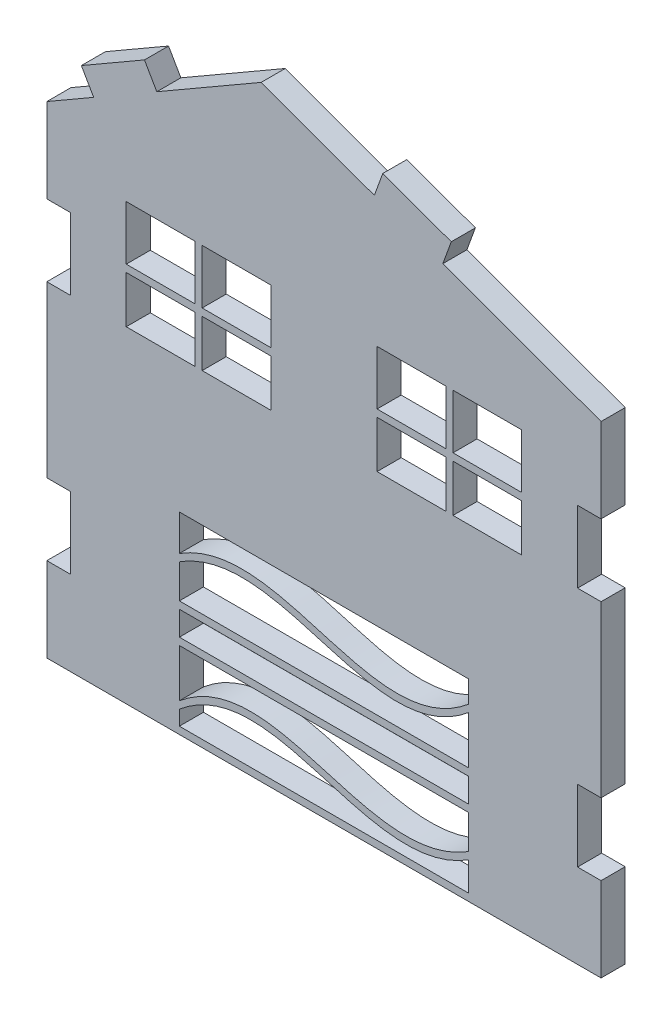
ISO-10303-21;
HEADER;
FILE_DESCRIPTION(('STEP AP214'),'2;1');
FILE_NAME('part.step','',(''),(''),'','','');
FILE_SCHEMA(('AUTOMOTIVE_DESIGN { 1 0 10303 214 1 1 1 1 }'));
ENDSEC;
DATA;
#1=APPLICATION_CONTEXT('core data for automotive mechanical design processes');
#2=APPLICATION_PROTOCOL_DEFINITION('international standard','automotive_design',2000,#1);
#3=PRODUCT_CONTEXT('',#1,'mechanical');
#4=PRODUCT('Part','Part','',(#3));
#5=PRODUCT_RELATED_PRODUCT_CATEGORY('part','',(#4));
#6=PRODUCT_DEFINITION_FORMATION('','',#4);
#7=PRODUCT_DEFINITION_CONTEXT('part definition',#1,'design');
#8=PRODUCT_DEFINITION('design','',#6,#7);
#9=PRODUCT_DEFINITION_SHAPE('','',#8);
#10=(LENGTH_UNIT() NAMED_UNIT(*) SI_UNIT(.MILLI.,.METRE.));
#11=(NAMED_UNIT(*) PLANE_ANGLE_UNIT() SI_UNIT($,.RADIAN.));
#12=(NAMED_UNIT(*) SI_UNIT($,.STERADIAN.) SOLID_ANGLE_UNIT());
#13=UNCERTAINTY_MEASURE_WITH_UNIT(LENGTH_MEASURE(1.E-05),#10,'distance_accuracy_value','');
#14=(GEOMETRIC_REPRESENTATION_CONTEXT(3) GLOBAL_UNCERTAINTY_ASSIGNED_CONTEXT((#13)) GLOBAL_UNIT_ASSIGNED_CONTEXT((#10,
#11,#12)) REPRESENTATION_CONTEXT('',''));
#15=CARTESIAN_POINT('',(0.,0.,0.));
#16=DIRECTION('',(0.,0.,1.));
#17=DIRECTION('',(1.,0.,0.));
#18=AXIS2_PLACEMENT_3D('',#15,#16,#17);
#19=CARTESIAN_POINT('',(0.,0.,10.));
#20=DIRECTION('',(0.,0.,1.));
#21=DIRECTION('',(1.,0.,0.));
#22=AXIS2_PLACEMENT_3D('',#19,#20,#21);
#23=PLANE('',#22);
#24=DIRECTION('',(0.,1.,0.));
#25=VECTOR('',#24,1.);
#26=CARTESIAN_POINT('',(0.,35.,10.));
#27=LINE('',#26,#25);
#28=CARTESIAN_POINT('',(0.,0.,10.));
#29=VERTEX_POINT('',#28);
#30=CARTESIAN_POINT('',(0.,35.,10.));
#31=VERTEX_POINT('',#30);
#32=EDGE_CURVE('E1112',#29,#31,#27,.T.);
#33=ORIENTED_EDGE('',*,*,#32,.T.);
#34=DIRECTION('',(-1.,0.,0.));
#35=VECTOR('',#34,1.);
#36=CARTESIAN_POINT('',(0.,35.,10.));
#37=LINE('',#36,#35);
#38=CARTESIAN_POINT('',(-9.76000000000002,35.,10.));
#39=VERTEX_POINT('',#38);
#40=EDGE_CURVE('E1117',#31,#39,#37,.T.);
#41=ORIENTED_EDGE('',*,*,#40,.T.);
#42=DIRECTION('',(0.,1.,0.));
#43=VECTOR('',#42,1.);
#44=CARTESIAN_POINT('',(-9.76000000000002,64.76,10.));
#45=LINE('',#44,#43);
#46=CARTESIAN_POINT('',(-9.76000000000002,64.76,10.));
#47=VERTEX_POINT('',#46);
#48=EDGE_CURVE('E1127',#39,#47,#45,.T.);
#49=ORIENTED_EDGE('',*,*,#48,.T.);
#50=DIRECTION('',(1.,0.,0.));
#51=VECTOR('',#50,1.);
#52=CARTESIAN_POINT('',(0.,64.76,10.));
#53=LINE('',#52,#51);
#54=CARTESIAN_POINT('',(0.,64.76,10.));
#55=VERTEX_POINT('',#54);
#56=EDGE_CURVE('E1130',#47,#55,#53,.T.);
#57=ORIENTED_EDGE('',*,*,#56,.T.);
#58=DIRECTION('',(0.,1.,0.));
#59=VECTOR('',#58,1.);
#60=CARTESIAN_POINT('',(0.,135.24,10.));
#61=LINE('',#60,#59);
#62=CARTESIAN_POINT('',(0.,135.24,10.));
#63=VERTEX_POINT('',#62);
#64=EDGE_CURVE('E1134',#55,#63,#61,.T.);
#65=ORIENTED_EDGE('',*,*,#64,.T.);
#66=DIRECTION('',(-1.,0.,0.));
#67=VECTOR('',#66,1.);
#68=CARTESIAN_POINT('',(0.,135.24,10.));
#69=LINE('',#68,#67);
#70=CARTESIAN_POINT('',(-9.76000000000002,135.24,10.));
#71=VERTEX_POINT('',#70);
#72=EDGE_CURVE('E1138',#63,#71,#69,.T.);
#73=ORIENTED_EDGE('',*,*,#72,.T.);
#74=DIRECTION('',(0.,1.,0.));
#75=VECTOR('',#74,1.);
#76=CARTESIAN_POINT('',(-9.76000000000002,135.24,10.));
#77=LINE('',#76,#75);
#78=CARTESIAN_POINT('',(-9.76000000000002,165.,10.));
#79=VERTEX_POINT('',#78);
#80=EDGE_CURVE('E1146',#71,#79,#77,.T.);
#81=ORIENTED_EDGE('',*,*,#80,.T.);
#82=DIRECTION('',(1.,0.,0.));
#83=VECTOR('',#82,1.);
#84=CARTESIAN_POINT('',(0.,165.,10.));
#85=LINE('',#84,#83);
#86=CARTESIAN_POINT('',(0.,165.,10.));
#87=VERTEX_POINT('',#86);
#88=EDGE_CURVE('E1149',#79,#87,#85,.T.);
#89=ORIENTED_EDGE('',*,*,#88,.T.);
#90=DIRECTION('',(0.,1.,0.));
#91=VECTOR('',#90,1.);
#92=CARTESIAN_POINT('',(0.,175.,10.));
#93=LINE('',#92,#91);
#94=CARTESIAN_POINT('',(0.,200.,10.));
#95=VERTEX_POINT('',#94);
#96=EDGE_CURVE('E1153',#87,#95,#93,.T.);
#97=ORIENTED_EDGE('',*,*,#96,.T.);
#98=DIRECTION('',(-0.93969262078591,0.342020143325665,0.));
#99=VECTOR('',#98,1.);
#100=CARTESIAN_POINT('',(-65.6674477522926,223.900996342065,10.));
#101=LINE('',#100,#99);
#102=CARTESIAN_POINT('',(-65.6674477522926,223.900996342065,10.));
#103=VERTEX_POINT('',#102);
#104=EDGE_CURVE('E1157',#95,#103,#101,.T.);
#105=ORIENTED_EDGE('',*,*,#104,.T.);
#106=DIRECTION('',(0.342020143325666,0.939692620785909,0.));
#107=VECTOR('',#106,1.);
#108=CARTESIAN_POINT('',(-62.1651614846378,233.523448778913,10.));
#109=LINE('',#108,#107);
#110=CARTESIAN_POINT('',(-62.1651614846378,233.523448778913,10.));
#111=VERTEX_POINT('',#110);
#112=EDGE_CURVE('E1165',#103,#111,#109,.T.);
#113=ORIENTED_EDGE('',*,*,#112,.T.);
#114=DIRECTION('',(-0.939692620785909,0.342020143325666,0.));
#115=VECTOR('',#114,1.);
#116=CARTESIAN_POINT('',(-90.5814663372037,243.866137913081,10.));
#117=LINE('',#116,#115);
#118=CARTESIAN_POINT('',(-90.5814663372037,243.866137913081,10.));
#119=VERTEX_POINT('',#118);
#120=EDGE_CURVE('E1168',#111,#119,#117,.T.);
#121=ORIENTED_EDGE('',*,*,#120,.T.);
#122=DIRECTION('',(-0.342020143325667,-0.939692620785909,0.));
#123=VECTOR('',#122,1.);
#124=CARTESIAN_POINT('',(-94.0837526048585,234.243685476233,10.));
#125=LINE('',#124,#123);
#126=CARTESIAN_POINT('',(-94.0837526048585,234.243685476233,10.));
#127=VERTEX_POINT('',#126);
#128=EDGE_CURVE('E1172',#119,#127,#125,.T.);
#129=ORIENTED_EDGE('',*,*,#128,.T.);
#130=DIRECTION('',(-0.939692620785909,0.342020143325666,0.));
#131=VECTOR('',#130,1.);
#132=CARTESIAN_POINT('',(-141.068383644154,251.344692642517,10.));
#133=LINE('',#132,#131);
#134=CARTESIAN_POINT('',(-141.068383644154,251.344692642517,10.));
#135=VERTEX_POINT('',#134);
#136=EDGE_CURVE('E1176',#127,#135,#133,.T.);
#137=ORIENTED_EDGE('',*,*,#136,.T.);
#138=DIRECTION('',(-0.866025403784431,-0.500000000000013,0.));
#139=VECTOR('',#138,1.);
#140=CARTESIAN_POINT('',(-184.369653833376,226.344692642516,10.));
#141=LINE('',#140,#139);
#142=CARTESIAN_POINT('',(-184.369653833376,226.344692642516,10.));
#143=VERTEX_POINT('',#142);
#144=EDGE_CURVE('E1184',#135,#143,#141,.T.);
#145=ORIENTED_EDGE('',*,*,#144,.T.);
#146=DIRECTION('',(-0.500000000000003,0.866025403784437,0.));
#147=VECTOR('',#146,1.);
#148=CARTESIAN_POINT('',(-184.369653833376,226.344692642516,10.));
#149=LINE('',#148,#147);
#150=CARTESIAN_POINT('',(-189.489653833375,235.212792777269,10.));
#151=VERTEX_POINT('',#150);
#152=EDGE_CURVE('E1187',#143,#151,#149,.T.);
#153=ORIENTED_EDGE('',*,*,#152,.T.);
#154=DIRECTION('',(-0.866025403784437,-0.500000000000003,0.));
#155=VECTOR('',#154,1.);
#156=CARTESIAN_POINT('',(-215.678262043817,220.092792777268,10.));
#157=LINE('',#156,#155);
#158=CARTESIAN_POINT('',(-215.678262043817,220.092792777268,10.));
#159=VERTEX_POINT('',#158);
#160=EDGE_CURVE('E1191',#151,#159,#157,.T.);
#161=ORIENTED_EDGE('',*,*,#160,.T.);
#162=DIRECTION('',(0.500000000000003,-0.866025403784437,0.));
#163=VECTOR('',#162,1.);
#164=CARTESIAN_POINT('',(-210.558262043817,211.224692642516,10.));
#165=LINE('',#164,#163);
#166=CARTESIAN_POINT('',(-210.558262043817,211.224692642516,10.));
#167=VERTEX_POINT('',#166);
#168=EDGE_CURVE('E1195',#159,#167,#165,.T.);
#169=ORIENTED_EDGE('',*,*,#168,.T.);
#170=DIRECTION('',(-0.866025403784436,-0.500000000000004,0.));
#171=VECTOR('',#170,1.);
#172=CARTESIAN_POINT('',(-230.,199.999999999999,10.));
#173=LINE('',#172,#171);
#174=CARTESIAN_POINT('',(-230.,199.999999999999,10.));
#175=VERTEX_POINT('',#174);
#176=EDGE_CURVE('E1203',#167,#175,#173,.T.);
#177=ORIENTED_EDGE('',*,*,#176,.T.);
#178=DIRECTION('',(0.,-1.,0.));
#179=VECTOR('',#178,1.);
#180=CARTESIAN_POINT('',(-230.,175.,10.));
#181=LINE('',#180,#179);
#182=CARTESIAN_POINT('',(-230.,165.,10.));
#183=VERTEX_POINT('',#182);
#184=EDGE_CURVE('E1206',#175,#183,#181,.T.);
#185=ORIENTED_EDGE('',*,*,#184,.T.);
#186=DIRECTION('',(1.,0.,0.));
#187=VECTOR('',#186,1.);
#188=CARTESIAN_POINT('',(-230.,165.,10.));
#189=LINE('',#188,#187);
#190=CARTESIAN_POINT('',(-220.24,165.,10.));
#191=VERTEX_POINT('',#190);
#192=EDGE_CURVE('E1210',#183,#191,#189,.T.);
#193=ORIENTED_EDGE('',*,*,#192,.T.);
#194=DIRECTION('',(0.,-1.,0.));
#195=VECTOR('',#194,1.);
#196=CARTESIAN_POINT('',(-220.24,135.24,10.));
#197=LINE('',#196,#195);
#198=CARTESIAN_POINT('',(-220.24,135.24,10.));
#199=VERTEX_POINT('',#198);
#200=EDGE_CURVE('E1214',#191,#199,#197,.T.);
#201=ORIENTED_EDGE('',*,*,#200,.T.);
#202=DIRECTION('',(-1.,0.,0.));
#203=VECTOR('',#202,1.);
#204=CARTESIAN_POINT('',(-230.,135.24,10.));
#205=LINE('',#204,#203);
#206=CARTESIAN_POINT('',(-230.,135.24,10.));
#207=VERTEX_POINT('',#206);
#208=EDGE_CURVE('E1222',#199,#207,#205,.T.);
#209=ORIENTED_EDGE('',*,*,#208,.T.);
#210=DIRECTION('',(0.,-1.,0.));
#211=VECTOR('',#210,1.);
#212=CARTESIAN_POINT('',(-230.,64.76,10.));
#213=LINE('',#212,#211);
#214=CARTESIAN_POINT('',(-230.,64.76,10.));
#215=VERTEX_POINT('',#214);
#216=EDGE_CURVE('E1225',#207,#215,#213,.T.);
#217=ORIENTED_EDGE('',*,*,#216,.T.);
#218=DIRECTION('',(1.,0.,0.));
#219=VECTOR('',#218,1.);
#220=CARTESIAN_POINT('',(-230.,64.76,10.));
#221=LINE('',#220,#219);
#222=CARTESIAN_POINT('',(-220.24,64.76,10.));
#223=VERTEX_POINT('',#222);
#224=EDGE_CURVE('E1229',#215,#223,#221,.T.);
#225=ORIENTED_EDGE('',*,*,#224,.T.);
#226=DIRECTION('',(0.,-1.,0.));
#227=VECTOR('',#226,1.);
#228=CARTESIAN_POINT('',(-220.24,64.76,10.));
#229=LINE('',#228,#227);
#230=CARTESIAN_POINT('',(-220.24,35.,10.));
#231=VERTEX_POINT('',#230);
#232=EDGE_CURVE('E1233',#223,#231,#229,.T.);
#233=ORIENTED_EDGE('',*,*,#232,.T.);
#234=DIRECTION('',(-1.,0.,0.));
#235=VECTOR('',#234,1.);
#236=CARTESIAN_POINT('',(-230.,35.,10.));
#237=LINE('',#236,#235);
#238=CARTESIAN_POINT('',(-230.,35.,10.));
#239=VERTEX_POINT('',#238);
#240=EDGE_CURVE('E1240',#231,#239,#237,.T.);
#241=ORIENTED_EDGE('',*,*,#240,.T.);
#242=DIRECTION('',(0.,-1.,0.));
#243=VECTOR('',#242,1.);
#244=CARTESIAN_POINT('',(-230.,0.,10.));
#245=LINE('',#244,#243);
#246=CARTESIAN_POINT('',(-230.,0.,10.));
#247=VERTEX_POINT('',#246);
#248=EDGE_CURVE('E1243',#239,#247,#245,.T.);
#249=ORIENTED_EDGE('',*,*,#248,.T.);
#250=DIRECTION('',(1.,0.,0.));
#251=VECTOR('',#250,1.);
#252=CARTESIAN_POINT('',(-230.,0.,10.));
#253=LINE('',#252,#251);
#254=EDGE_CURVE('E1247',#247,#29,#253,.T.);
#255=ORIENTED_EDGE('',*,*,#254,.T.);
#256=EDGE_LOOP('',(#33,#41,#49,#57,#65,#73,#81,#89,#97,#105,#113,#121,#129,#137,#145,#153,#161,
#169,#177,#185,#193,#201,#209,#217,#225,#233,#241,#249,#255));
#257=FACE_BOUND('',#256,.T.);
#258=CARTESIAN_POINT('',(-175.,65.0782088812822,10.));
#259=CARTESIAN_POINT('',(-134.06145029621,90.8446621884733,10.));
#260=CARTESIAN_POINT('',(-93.755078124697,38.5280933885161,10.));
#261=CARTESIAN_POINT('',(-55.,70.9021482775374,10.));
#262=B_SPLINE_CURVE_WITH_KNOTS('',3,(#258,#259,#260,#261),.UNSPECIFIED.,.F.,.F.,(4,4),(0.,1.),.UNSPECIFIED.);
#263=CARTESIAN_POINT('',(-175.,65.0782088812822,10.));
#264=VERTEX_POINT('',#263);
#265=CARTESIAN_POINT('',(-55.,70.9021482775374,10.));
#266=VERTEX_POINT('',#265);
#267=EDGE_CURVE('E1069',#264,#266,#262,.T.);
#268=ORIENTED_EDGE('',*,*,#267,.F.);
#269=DIRECTION('',(0.,-1.,0.));
#270=VECTOR('',#269,1.);
#271=CARTESIAN_POINT('',(-175.,80.,10.));
#272=LINE('',#271,#270);
#273=CARTESIAN_POINT('',(-175.,80.,10.));
#274=VERTEX_POINT('',#273);
#275=EDGE_CURVE('E1065',#274,#264,#272,.T.);
#276=ORIENTED_EDGE('',*,*,#275,.F.);
#277=DIRECTION('',(-1.,0.,0.));
#278=VECTOR('',#277,1.);
#279=CARTESIAN_POINT('',(-175.,80.,10.));
#280=LINE('',#279,#278);
#281=CARTESIAN_POINT('',(-55.,80.,10.));
#282=VERTEX_POINT('',#281);
#283=EDGE_CURVE('E1080',#282,#274,#280,.T.);
#284=ORIENTED_EDGE('',*,*,#283,.F.);
#285=DIRECTION('',(0.,1.,0.));
#286=VECTOR('',#285,1.);
#287=CARTESIAN_POINT('',(-55.,80.,10.));
#288=LINE('',#287,#286);
#289=EDGE_CURVE('E1085',#266,#282,#288,.T.);
#290=ORIENTED_EDGE('',*,*,#289,.F.);
#291=EDGE_LOOP('',(#268,#276,#284,#290));
#292=FACE_BOUND('',#291,.T.);
#293=DIRECTION('',(0.,-1.,0.));
#294=VECTOR('',#293,1.);
#295=CARTESIAN_POINT('',(-175.,62.0782088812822,10.));
#296=LINE('',#295,#294);
#297=CARTESIAN_POINT('',(-175.,62.0782088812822,10.));
#298=VERTEX_POINT('',#297);
#299=CARTESIAN_POINT('',(-175.,48.0362220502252,10.));
#300=VERTEX_POINT('',#299);
#301=EDGE_CURVE('E1016',#298,#300,#296,.T.);
#302=ORIENTED_EDGE('',*,*,#301,.F.);
#303=CARTESIAN_POINT('',(-55.,67.9021482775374,10.));
#304=CARTESIAN_POINT('',(-93.755078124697,35.528093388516,10.));
#305=CARTESIAN_POINT('',(-134.06145029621,87.8446621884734,10.));
#306=CARTESIAN_POINT('',(-175.,62.0782088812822,10.));
#307=B_SPLINE_CURVE_WITH_KNOTS('',3,(#303,#304,#305,#306),.UNSPECIFIED.,.F.,.F.,(4,4),(0.,1.),.UNSPECIFIED.);
#308=CARTESIAN_POINT('',(-55.,67.9021482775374,10.));
#309=VERTEX_POINT('',#308);
#310=EDGE_CURVE('E1010',#309,#298,#307,.T.);
#311=ORIENTED_EDGE('',*,*,#310,.F.);
#312=DIRECTION('',(0.,1.,0.));
#313=VECTOR('',#312,1.);
#314=CARTESIAN_POINT('',(-55.,67.9021482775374,10.));
#315=LINE('',#314,#313);
#316=CARTESIAN_POINT('',(-55.,48.0362220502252,10.));
#317=VERTEX_POINT('',#316);
#318=EDGE_CURVE('E1033',#317,#309,#315,.T.);
#319=ORIENTED_EDGE('',*,*,#318,.F.);
#320=DIRECTION('',(1.,0.,0.));
#321=VECTOR('',#320,1.);
#322=CARTESIAN_POINT('',(-175.,48.0362220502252,10.));
#323=LINE('',#322,#321);
#324=EDGE_CURVE('E1038',#300,#317,#323,.T.);
#325=ORIENTED_EDGE('',*,*,#324,.F.);
#326=EDGE_LOOP('',(#302,#311,#319,#325));
#327=FACE_BOUND('',#326,.T.);
#328=DIRECTION('',(0.,1.,0.));
#329=VECTOR('',#328,1.);
#330=CARTESIAN_POINT('',(-55.,45.0362220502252,10.));
#331=LINE('',#330,#329);
#332=CARTESIAN_POINT('',(-55.,35.,10.));
#333=VERTEX_POINT('',#332);
#334=CARTESIAN_POINT('',(-55.,45.0362220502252,10.));
#335=VERTEX_POINT('',#334);
#336=EDGE_CURVE('E974',#333,#335,#331,.T.);
#337=ORIENTED_EDGE('',*,*,#336,.F.);
#338=DIRECTION('',(1.,0.,0.));
#339=VECTOR('',#338,1.);
#340=CARTESIAN_POINT('',(-175.,35.,10.));
#341=LINE('',#340,#339);
#342=CARTESIAN_POINT('',(-175.,35.,10.));
#343=VERTEX_POINT('',#342);
#344=EDGE_CURVE('E970',#343,#333,#341,.T.);
#345=ORIENTED_EDGE('',*,*,#344,.F.);
#346=DIRECTION('',(0.,-1.,0.));
#347=VECTOR('',#346,1.);
#348=CARTESIAN_POINT('',(-175.,45.0362220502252,10.));
#349=LINE('',#348,#347);
#350=CARTESIAN_POINT('',(-175.,45.0362220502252,10.));
#351=VERTEX_POINT('',#350);
#352=EDGE_CURVE('E983',#351,#343,#349,.T.);
#353=ORIENTED_EDGE('',*,*,#352,.F.);
#354=DIRECTION('',(-1.,0.,0.));
#355=VECTOR('',#354,1.);
#356=CARTESIAN_POINT('',(-175.,45.0362220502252,10.));
#357=LINE('',#356,#355);
#358=EDGE_CURVE('E988',#335,#351,#357,.T.);
#359=ORIENTED_EDGE('',*,*,#358,.F.);
#360=EDGE_LOOP('',(#337,#345,#353,#359));
#361=FACE_BOUND('',#360,.T.);
#362=CARTESIAN_POINT('',(-175.,12.1340737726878,10.));
#363=CARTESIAN_POINT('',(-136.244921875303,44.5081286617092,10.));
#364=CARTESIAN_POINT('',(-95.9385497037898,-7.80844013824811,10.));
#365=CARTESIAN_POINT('',(-55.,17.958013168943,10.));
#366=B_SPLINE_CURVE_WITH_KNOTS('',3,(#362,#363,#364,#365),.UNSPECIFIED.,.F.,.F.,(4,4),(0.,1.),.UNSPECIFIED.);
#367=CARTESIAN_POINT('',(-175.,12.1340737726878,10.));
#368=VERTEX_POINT('',#367);
#369=CARTESIAN_POINT('',(-55.,17.958013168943,10.));
#370=VERTEX_POINT('',#369);
#371=EDGE_CURVE('E927',#368,#370,#366,.T.);
#372=ORIENTED_EDGE('',*,*,#371,.F.);
#373=DIRECTION('',(0.,-1.,0.));
#374=VECTOR('',#373,1.);
#375=CARTESIAN_POINT('',(-175.,32.,10.));
#376=LINE('',#375,#374);
#377=CARTESIAN_POINT('',(-175.,32.,10.));
#378=VERTEX_POINT('',#377);
#379=EDGE_CURVE('E923',#378,#368,#376,.T.);
#380=ORIENTED_EDGE('',*,*,#379,.F.);
#381=DIRECTION('',(-1.,0.,0.));
#382=VECTOR('',#381,1.);
#383=CARTESIAN_POINT('',(-175.,32.,10.));
#384=LINE('',#383,#382);
#385=CARTESIAN_POINT('',(-55.,32.,10.));
#386=VERTEX_POINT('',#385);
#387=EDGE_CURVE('E938',#386,#378,#384,.T.);
#388=ORIENTED_EDGE('',*,*,#387,.F.);
#389=DIRECTION('',(0.,1.,0.));
#390=VECTOR('',#389,1.);
#391=CARTESIAN_POINT('',(-55.,32.,10.));
#392=LINE('',#391,#390);
#393=EDGE_CURVE('E943',#370,#386,#392,.T.);
#394=ORIENTED_EDGE('',*,*,#393,.F.);
#395=EDGE_LOOP('',(#372,#380,#388,#394));
#396=FACE_BOUND('',#395,.T.);
#397=DIRECTION('',(0.,-1.,0.));
#398=VECTOR('',#397,1.);
#399=CARTESIAN_POINT('',(-175.,9.13407377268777,10.));
#400=LINE('',#399,#398);
#401=CARTESIAN_POINT('',(-175.,9.13407377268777,10.));
#402=VERTEX_POINT('',#401);
#403=CARTESIAN_POINT('',(-175.,2.99999999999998,10.));
#404=VERTEX_POINT('',#403);
#405=EDGE_CURVE('E874',#402,#404,#400,.T.);
#406=ORIENTED_EDGE('',*,*,#405,.F.);
#407=CARTESIAN_POINT('',(-55.,14.958013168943,10.));
#408=CARTESIAN_POINT('',(-95.9385497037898,-10.8084401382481,10.));
#409=CARTESIAN_POINT('',(-136.244921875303,41.5081286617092,10.));
#410=CARTESIAN_POINT('',(-175.,9.13407377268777,10.));
#411=B_SPLINE_CURVE_WITH_KNOTS('',3,(#407,#408,#409,#410),.UNSPECIFIED.,.F.,.F.,(4,4),(0.,1.),.UNSPECIFIED.);
#412=CARTESIAN_POINT('',(-55.,14.958013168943,10.));
#413=VERTEX_POINT('',#412);
#414=EDGE_CURVE('E868',#413,#402,#411,.T.);
#415=ORIENTED_EDGE('',*,*,#414,.F.);
#416=DIRECTION('',(0.,1.,0.));
#417=VECTOR('',#416,1.);
#418=CARTESIAN_POINT('',(-55.,14.958013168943,10.));
#419=LINE('',#418,#417);
#420=CARTESIAN_POINT('',(-55.,2.99999999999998,10.));
#421=VERTEX_POINT('',#420);
#422=EDGE_CURVE('E891',#421,#413,#419,.T.);
#423=ORIENTED_EDGE('',*,*,#422,.F.);
#424=DIRECTION('',(1.,0.,0.));
#425=VECTOR('',#424,1.);
#426=CARTESIAN_POINT('',(-175.,2.99999999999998,10.));
#427=LINE('',#426,#425);
#428=EDGE_CURVE('E896',#404,#421,#427,.T.);
#429=ORIENTED_EDGE('',*,*,#428,.F.);
#430=EDGE_LOOP('',(#406,#415,#423,#429));
#431=FACE_BOUND('',#430,.T.);
#432=DIRECTION('',(1.,0.,0.));
#433=VECTOR('',#432,1.);
#434=CARTESIAN_POINT('',(-168.551577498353,158.027582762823,10.));
#435=LINE('',#434,#433);
#436=CARTESIAN_POINT('',(-197.051577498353,158.027582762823,10.));
#437=VERTEX_POINT('',#436);
#438=CARTESIAN_POINT('',(-168.551577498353,158.027582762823,10.));
#439=VERTEX_POINT('',#438);
#440=EDGE_CURVE('E832',#437,#439,#435,.T.);
#441=ORIENTED_EDGE('',*,*,#440,.F.);
#442=DIRECTION('',(0.,-1.,0.));
#443=VECTOR('',#442,1.);
#444=CARTESIAN_POINT('',(-197.051577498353,180.527582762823,10.));
#445=LINE('',#444,#443);
#446=CARTESIAN_POINT('',(-197.051577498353,180.527582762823,10.));
#447=VERTEX_POINT('',#446);
#448=EDGE_CURVE('E828',#447,#437,#445,.T.);
#449=ORIENTED_EDGE('',*,*,#448,.F.);
#450=DIRECTION('',(-1.,0.,0.));
#451=VECTOR('',#450,1.);
#452=CARTESIAN_POINT('',(-197.051577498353,180.527582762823,10.));
#453=LINE('',#452,#451);
#454=CARTESIAN_POINT('',(-168.551577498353,180.527582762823,10.));
#455=VERTEX_POINT('',#454);
#456=EDGE_CURVE('E841',#455,#447,#453,.T.);
#457=ORIENTED_EDGE('',*,*,#456,.F.);
#458=DIRECTION('',(0.,1.,0.));
#459=VECTOR('',#458,1.);
#460=CARTESIAN_POINT('',(-168.551577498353,180.527582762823,10.));
#461=LINE('',#460,#459);
#462=EDGE_CURVE('E846',#439,#455,#461,.T.);
#463=ORIENTED_EDGE('',*,*,#462,.F.);
#464=EDGE_LOOP('',(#441,#449,#457,#463));
#465=FACE_BOUND('',#464,.T.);
#466=DIRECTION('',(0.,1.,0.));
#467=VECTOR('',#466,1.);
#468=CARTESIAN_POINT('',(-137.051577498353,155.027582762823,10.));
#469=LINE('',#468,#467);
#470=CARTESIAN_POINT('',(-137.051577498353,135.527582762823,10.));
#471=VERTEX_POINT('',#470);
#472=CARTESIAN_POINT('',(-137.051577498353,155.027582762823,10.));
#473=VERTEX_POINT('',#472);
#474=EDGE_CURVE('E792',#471,#473,#469,.T.);
#475=ORIENTED_EDGE('',*,*,#474,.F.);
#476=DIRECTION('',(1.,0.,0.));
#477=VECTOR('',#476,1.);
#478=CARTESIAN_POINT('',(-165.551577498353,135.527582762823,10.));
#479=LINE('',#478,#477);
#480=CARTESIAN_POINT('',(-165.551577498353,135.527582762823,10.));
#481=VERTEX_POINT('',#480);
#482=EDGE_CURVE('E788',#481,#471,#479,.T.);
#483=ORIENTED_EDGE('',*,*,#482,.F.);
#484=DIRECTION('',(0.,-1.,0.));
#485=VECTOR('',#484,1.);
#486=CARTESIAN_POINT('',(-165.551577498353,155.027582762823,10.));
#487=LINE('',#486,#485);
#488=CARTESIAN_POINT('',(-165.551577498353,155.027582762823,10.));
#489=VERTEX_POINT('',#488);
#490=EDGE_CURVE('E801',#489,#481,#487,.T.);
#491=ORIENTED_EDGE('',*,*,#490,.F.);
#492=DIRECTION('',(-1.,0.,0.));
#493=VECTOR('',#492,1.);
#494=CARTESIAN_POINT('',(-137.051577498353,155.027582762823,10.));
#495=LINE('',#494,#493);
#496=EDGE_CURVE('E806',#473,#489,#495,.T.);
#497=ORIENTED_EDGE('',*,*,#496,.F.);
#498=EDGE_LOOP('',(#475,#483,#491,#497));
#499=FACE_BOUND('',#498,.T.);
#500=DIRECTION('',(1.,0.,0.));
#501=VECTOR('',#500,1.);
#502=CARTESIAN_POINT('',(-197.051577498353,135.527582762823,10.));
#503=LINE('',#502,#501);
#504=CARTESIAN_POINT('',(-197.051577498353,135.527582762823,10.));
#505=VERTEX_POINT('',#504);
#506=CARTESIAN_POINT('',(-168.551577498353,135.527582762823,10.));
#507=VERTEX_POINT('',#506);
#508=EDGE_CURVE('E752',#505,#507,#503,.T.);
#509=ORIENTED_EDGE('',*,*,#508,.F.);
#510=DIRECTION('',(0.,-1.,0.));
#511=VECTOR('',#510,1.);
#512=CARTESIAN_POINT('',(-197.051577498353,155.027582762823,10.));
#513=LINE('',#512,#511);
#514=CARTESIAN_POINT('',(-197.051577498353,155.027582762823,10.));
#515=VERTEX_POINT('',#514);
#516=EDGE_CURVE('E748',#515,#505,#513,.T.);
#517=ORIENTED_EDGE('',*,*,#516,.F.);
#518=DIRECTION('',(-1.,0.,0.));
#519=VECTOR('',#518,1.);
#520=CARTESIAN_POINT('',(-197.051577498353,155.027582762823,10.));
#521=LINE('',#520,#519);
#522=CARTESIAN_POINT('',(-168.551577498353,155.027582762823,10.));
#523=VERTEX_POINT('',#522);
#524=EDGE_CURVE('E761',#523,#515,#521,.T.);
#525=ORIENTED_EDGE('',*,*,#524,.F.);
#526=DIRECTION('',(0.,1.,0.));
#527=VECTOR('',#526,1.);
#528=CARTESIAN_POINT('',(-168.551577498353,155.027582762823,10.));
#529=LINE('',#528,#527);
#530=EDGE_CURVE('E766',#507,#523,#529,.T.);
#531=ORIENTED_EDGE('',*,*,#530,.F.);
#532=EDGE_LOOP('',(#509,#517,#525,#531));
#533=FACE_BOUND('',#532,.T.);
#534=DIRECTION('',(0.,-1.,0.));
#535=VECTOR('',#534,1.);
#536=CARTESIAN_POINT('',(-165.551577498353,180.527582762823,10.));
#537=LINE('',#536,#535);
#538=CARTESIAN_POINT('',(-165.551577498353,180.527582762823,10.));
#539=VERTEX_POINT('',#538);
#540=CARTESIAN_POINT('',(-165.551577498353,158.027582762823,10.));
#541=VERTEX_POINT('',#540);
#542=EDGE_CURVE('E712',#539,#541,#537,.T.);
#543=ORIENTED_EDGE('',*,*,#542,.F.);
#544=DIRECTION('',(-1.,0.,0.));
#545=VECTOR('',#544,1.);
#546=CARTESIAN_POINT('',(-165.551577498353,180.527582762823,10.));
#547=LINE('',#546,#545);
#548=CARTESIAN_POINT('',(-137.051577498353,180.527582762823,10.));
#549=VERTEX_POINT('',#548);
#550=EDGE_CURVE('E708',#549,#539,#547,.T.);
#551=ORIENTED_EDGE('',*,*,#550,.F.);
#552=DIRECTION('',(0.,1.,0.));
#553=VECTOR('',#552,1.);
#554=CARTESIAN_POINT('',(-137.051577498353,180.527582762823,10.));
#555=LINE('',#554,#553);
#556=CARTESIAN_POINT('',(-137.051577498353,158.027582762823,10.));
#557=VERTEX_POINT('',#556);
#558=EDGE_CURVE('E721',#557,#549,#555,.T.);
#559=ORIENTED_EDGE('',*,*,#558,.F.);
#560=DIRECTION('',(1.,0.,0.));
#561=VECTOR('',#560,1.);
#562=CARTESIAN_POINT('',(-165.551577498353,158.027582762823,10.));
#563=LINE('',#562,#561);
#564=EDGE_CURVE('E726',#541,#557,#563,.T.);
#565=ORIENTED_EDGE('',*,*,#564,.F.);
#566=EDGE_LOOP('',(#543,#551,#559,#565));
#567=FACE_BOUND('',#566,.T.);
#568=DIRECTION('',(-1.,0.,0.));
#569=VECTOR('',#568,1.);
#570=CARTESIAN_POINT('',(-92.9484225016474,155.027582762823,10.));
#571=LINE('',#570,#569);
#572=CARTESIAN_POINT('',(-64.4484225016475,155.027582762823,10.));
#573=VERTEX_POINT('',#572);
#574=CARTESIAN_POINT('',(-92.9484225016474,155.027582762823,10.));
#575=VERTEX_POINT('',#574);
#576=EDGE_CURVE('E672',#573,#575,#571,.T.);
#577=ORIENTED_EDGE('',*,*,#576,.F.);
#578=DIRECTION('',(0.,1.,0.));
#579=VECTOR('',#578,1.);
#580=CARTESIAN_POINT('',(-64.4484225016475,155.027582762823,10.));
#581=LINE('',#580,#579);
#582=CARTESIAN_POINT('',(-64.4484225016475,135.527582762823,10.));
#583=VERTEX_POINT('',#582);
#584=EDGE_CURVE('E668',#583,#573,#581,.T.);
#585=ORIENTED_EDGE('',*,*,#584,.F.);
#586=DIRECTION('',(1.,0.,0.));
#587=VECTOR('',#586,1.);
#588=CARTESIAN_POINT('',(-64.4484225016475,135.527582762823,10.));
#589=LINE('',#588,#587);
#590=CARTESIAN_POINT('',(-92.9484225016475,135.527582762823,10.));
#591=VERTEX_POINT('',#590);
#592=EDGE_CURVE('E681',#591,#583,#589,.T.);
#593=ORIENTED_EDGE('',*,*,#592,.F.);
#594=DIRECTION('',(0.,-1.,0.));
#595=VECTOR('',#594,1.);
#596=CARTESIAN_POINT('',(-92.9484225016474,155.027582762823,10.));
#597=LINE('',#596,#595);
#598=EDGE_CURVE('E686',#575,#591,#597,.T.);
#599=ORIENTED_EDGE('',*,*,#598,.F.);
#600=EDGE_LOOP('',(#577,#585,#593,#599));
#601=FACE_BOUND('',#600,.T.);
#602=DIRECTION('',(-1.,0.,0.));
#603=VECTOR('',#602,1.);
#604=CARTESIAN_POINT('',(-64.4484225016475,180.527582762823,10.));
#605=LINE('',#604,#603);
#606=CARTESIAN_POINT('',(-64.4484225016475,180.527582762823,10.));
#607=VERTEX_POINT('',#606);
#608=CARTESIAN_POINT('',(-92.9484225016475,180.527582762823,10.));
#609=VERTEX_POINT('',#608);
#610=EDGE_CURVE('E632',#607,#609,#605,.T.);
#611=ORIENTED_EDGE('',*,*,#610,.F.);
#612=DIRECTION('',(0.,1.,0.));
#613=VECTOR('',#612,1.);
#614=CARTESIAN_POINT('',(-64.4484225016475,180.527582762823,10.));
#615=LINE('',#614,#613);
#616=CARTESIAN_POINT('',(-64.4484225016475,158.027582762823,10.));
#617=VERTEX_POINT('',#616);
#618=EDGE_CURVE('E628',#617,#607,#615,.T.);
#619=ORIENTED_EDGE('',*,*,#618,.F.);
#620=DIRECTION('',(1.,0.,0.));
#621=VECTOR('',#620,1.);
#622=CARTESIAN_POINT('',(-64.4484225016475,158.027582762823,10.));
#623=LINE('',#622,#621);
#624=CARTESIAN_POINT('',(-92.9484225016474,158.027582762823,10.));
#625=VERTEX_POINT('',#624);
#626=EDGE_CURVE('E641',#625,#617,#623,.T.);
#627=ORIENTED_EDGE('',*,*,#626,.F.);
#628=DIRECTION('',(0.,-1.,0.));
#629=VECTOR('',#628,1.);
#630=CARTESIAN_POINT('',(-92.9484225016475,180.527582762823,10.));
#631=LINE('',#630,#629);
#632=EDGE_CURVE('E646',#609,#625,#631,.T.);
#633=ORIENTED_EDGE('',*,*,#632,.F.);
#634=EDGE_LOOP('',(#611,#619,#627,#633));
#635=FACE_BOUND('',#634,.T.);
#636=DIRECTION('',(0.,-1.,0.));
#637=VECTOR('',#636,1.);
#638=CARTESIAN_POINT('',(-61.4484225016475,155.027582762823,10.));
#639=LINE('',#638,#637);
#640=CARTESIAN_POINT('',(-61.4484225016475,155.027582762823,10.));
#641=VERTEX_POINT('',#640);
#642=CARTESIAN_POINT('',(-61.4484225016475,135.527582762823,10.));
#643=VERTEX_POINT('',#642);
#644=EDGE_CURVE('E594',#641,#643,#639,.T.);
#645=ORIENTED_EDGE('',*,*,#644,.F.);
#646=DIRECTION('',(-1.,0.,0.));
#647=VECTOR('',#646,1.);
#648=CARTESIAN_POINT('',(-32.9484225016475,155.027582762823,10.));
#649=LINE('',#648,#647);
#650=CARTESIAN_POINT('',(-32.9484225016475,155.027582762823,10.));
#651=VERTEX_POINT('',#650);
#652=EDGE_CURVE('E590',#651,#641,#649,.T.);
#653=ORIENTED_EDGE('',*,*,#652,.F.);
#654=DIRECTION('',(0.,1.,0.));
#655=VECTOR('',#654,1.);
#656=CARTESIAN_POINT('',(-32.9484225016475,155.027582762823,10.));
#657=LINE('',#656,#655);
#658=CARTESIAN_POINT('',(-32.9484225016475,135.527582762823,10.));
#659=VERTEX_POINT('',#658);
#660=EDGE_CURVE('E601',#659,#651,#657,.T.);
#661=ORIENTED_EDGE('',*,*,#660,.F.);
#662=DIRECTION('',(1.,0.,0.));
#663=VECTOR('',#662,1.);
#664=CARTESIAN_POINT('',(-32.9484225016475,135.527582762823,10.));
#665=LINE('',#664,#663);
#666=EDGE_CURVE('E606',#643,#659,#665,.T.);
#667=ORIENTED_EDGE('',*,*,#666,.F.);
#668=EDGE_LOOP('',(#645,#653,#661,#667));
#669=FACE_BOUND('',#668,.T.);
#670=DIRECTION('',(1.,0.,0.));
#671=VECTOR('',#670,1.);
#672=CARTESIAN_POINT('',(-61.4484225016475,158.027582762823,10.));
#673=LINE('',#672,#671);
#674=CARTESIAN_POINT('',(-61.4484225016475,158.027582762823,10.));
#675=VERTEX_POINT('',#674);
#676=CARTESIAN_POINT('',(-32.9484225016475,158.027582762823,10.));
#677=VERTEX_POINT('',#676);
#678=EDGE_CURVE('E550',#675,#677,#673,.T.);
#679=ORIENTED_EDGE('',*,*,#678,.F.);
#680=DIRECTION('',(0.,-1.,0.));
#681=VECTOR('',#680,1.);
#682=CARTESIAN_POINT('',(-61.4484225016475,180.527582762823,10.));
#683=LINE('',#682,#681);
#684=CARTESIAN_POINT('',(-61.4484225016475,180.527582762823,10.));
#685=VERTEX_POINT('',#684);
#686=EDGE_CURVE('E541',#685,#675,#683,.T.);
#687=ORIENTED_EDGE('',*,*,#686,.F.);
#688=DIRECTION('',(-1.,0.,0.));
#689=VECTOR('',#688,1.);
#690=CARTESIAN_POINT('',(-32.9484225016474,180.527582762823,10.));
#691=LINE('',#690,#689);
#692=CARTESIAN_POINT('',(-32.9484225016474,180.527582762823,10.));
#693=VERTEX_POINT('',#692);
#694=EDGE_CURVE('E567',#693,#685,#691,.T.);
#695=ORIENTED_EDGE('',*,*,#694,.F.);
#696=DIRECTION('',(0.,1.,0.));
#697=VECTOR('',#696,1.);
#698=CARTESIAN_POINT('',(-32.9484225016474,180.527582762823,10.));
#699=LINE('',#698,#697);
#700=EDGE_CURVE('E562',#677,#693,#699,.T.);
#701=ORIENTED_EDGE('',*,*,#700,.F.);
#702=EDGE_LOOP('',(#679,#687,#695,#701));
#703=FACE_BOUND('',#702,.T.);
#704=ADVANCED_FACE('F38',(#257,#292,#327,#361,#396,#431,#465,#499,#533,#567,#601,#635,#669,
#703),#23,.T.);
#705=CARTESIAN_POINT('',(0.,0.,0.));
#706=DIRECTION('',(0.,0.,1.));
#707=DIRECTION('',(1.,0.,0.));
#708=AXIS2_PLACEMENT_3D('',#705,#706,#707);
#709=PLANE('',#708);
#710=DIRECTION('',(-1.,0.,0.));
#711=VECTOR('',#710,1.);
#712=CARTESIAN_POINT('',(-32.9484225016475,155.027582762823,0.));
#713=LINE('',#712,#711);
#714=CARTESIAN_POINT('',(-32.9484225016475,155.027582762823,0.));
#715=VERTEX_POINT('',#714);
#716=CARTESIAN_POINT('',(-61.4484225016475,155.027582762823,0.));
#717=VERTEX_POINT('',#716);
#718=EDGE_CURVE('E558',#715,#717,#713,.T.);
#719=ORIENTED_EDGE('',*,*,#718,.T.);
#720=DIRECTION('',(0.,-1.,0.));
#721=VECTOR('',#720,1.);
#722=CARTESIAN_POINT('',(-61.4484225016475,155.027582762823,0.));
#723=LINE('',#722,#721);
#724=CARTESIAN_POINT('',(-61.4484225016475,135.527582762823,0.));
#725=VERTEX_POINT('',#724);
#726=EDGE_CURVE('E610',#717,#725,#723,.T.);
#727=ORIENTED_EDGE('',*,*,#726,.T.);
#728=DIRECTION('',(1.,0.,0.));
#729=VECTOR('',#728,1.);
#730=CARTESIAN_POINT('',(-32.9484225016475,135.527582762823,0.));
#731=LINE('',#730,#729);
#732=CARTESIAN_POINT('',(-32.9484225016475,135.527582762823,0.));
#733=VERTEX_POINT('',#732);
#734=EDGE_CURVE('E613',#725,#733,#731,.T.);
#735=ORIENTED_EDGE('',*,*,#734,.T.);
#736=DIRECTION('',(0.,1.,0.));
#737=VECTOR('',#736,1.);
#738=CARTESIAN_POINT('',(-32.9484225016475,155.027582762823,0.));
#739=LINE('',#738,#737);
#740=EDGE_CURVE('E595',#733,#715,#739,.T.);
#741=ORIENTED_EDGE('',*,*,#740,.T.);
#742=EDGE_LOOP('',(#719,#727,#735,#741));
#743=FACE_BOUND('',#742,.T.);
#744=DIRECTION('',(0.,1.,0.));
#745=VECTOR('',#744,1.);
#746=CARTESIAN_POINT('',(-64.4484225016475,155.027582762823,0.));
#747=LINE('',#746,#745);
#748=CARTESIAN_POINT('',(-64.4484225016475,135.527582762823,0.));
#749=VERTEX_POINT('',#748);
#750=CARTESIAN_POINT('',(-64.4484225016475,155.027582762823,0.));
#751=VERTEX_POINT('',#750);
#752=EDGE_CURVE('E667',#749,#751,#747,.T.);
#753=ORIENTED_EDGE('',*,*,#752,.T.);
#754=DIRECTION('',(-1.,0.,0.));
#755=VECTOR('',#754,1.);
#756=CARTESIAN_POINT('',(-92.9484225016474,155.027582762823,0.));
#757=LINE('',#756,#755);
#758=CARTESIAN_POINT('',(-92.9484225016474,155.027582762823,0.));
#759=VERTEX_POINT('',#758);
#760=EDGE_CURVE('E690',#751,#759,#757,.T.);
#761=ORIENTED_EDGE('',*,*,#760,.T.);
#762=DIRECTION('',(0.,-1.,0.));
#763=VECTOR('',#762,1.);
#764=CARTESIAN_POINT('',(-92.9484225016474,155.027582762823,0.));
#765=LINE('',#764,#763);
#766=CARTESIAN_POINT('',(-92.9484225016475,135.527582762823,0.));
#767=VERTEX_POINT('',#766);
#768=EDGE_CURVE('E693',#759,#767,#765,.T.);
#769=ORIENTED_EDGE('',*,*,#768,.T.);
#770=DIRECTION('',(1.,0.,0.));
#771=VECTOR('',#770,1.);
#772=CARTESIAN_POINT('',(-64.4484225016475,135.527582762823,0.));
#773=LINE('',#772,#771);
#774=EDGE_CURVE('E673',#767,#749,#773,.T.);
#775=ORIENTED_EDGE('',*,*,#774,.T.);
#776=EDGE_LOOP('',(#753,#761,#769,#775));
#777=FACE_BOUND('',#776,.T.);
#778=DIRECTION('',(0.,-1.,0.));
#779=VECTOR('',#778,1.);
#780=CARTESIAN_POINT('',(-197.051577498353,155.027582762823,0.));
#781=LINE('',#780,#779);
#782=CARTESIAN_POINT('',(-197.051577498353,155.027582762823,0.));
#783=VERTEX_POINT('',#782);
#784=CARTESIAN_POINT('',(-197.051577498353,135.527582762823,0.));
#785=VERTEX_POINT('',#784);
#786=EDGE_CURVE('E747',#783,#785,#781,.T.);
#787=ORIENTED_EDGE('',*,*,#786,.T.);
#788=DIRECTION('',(1.,0.,0.));
#789=VECTOR('',#788,1.);
#790=CARTESIAN_POINT('',(-197.051577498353,135.527582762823,0.));
#791=LINE('',#790,#789);
#792=CARTESIAN_POINT('',(-168.551577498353,135.527582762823,0.));
#793=VERTEX_POINT('',#792);
#794=EDGE_CURVE('E770',#785,#793,#791,.T.);
#795=ORIENTED_EDGE('',*,*,#794,.T.);
#796=DIRECTION('',(0.,1.,0.));
#797=VECTOR('',#796,1.);
#798=CARTESIAN_POINT('',(-168.551577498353,155.027582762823,0.));
#799=LINE('',#798,#797);
#800=CARTESIAN_POINT('',(-168.551577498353,155.027582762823,0.));
#801=VERTEX_POINT('',#800);
#802=EDGE_CURVE('E773',#793,#801,#799,.T.);
#803=ORIENTED_EDGE('',*,*,#802,.T.);
#804=DIRECTION('',(-1.,0.,0.));
#805=VECTOR('',#804,1.);
#806=CARTESIAN_POINT('',(-197.051577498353,155.027582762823,0.));
#807=LINE('',#806,#805);
#808=EDGE_CURVE('E753',#801,#783,#807,.T.);
#809=ORIENTED_EDGE('',*,*,#808,.T.);
#810=EDGE_LOOP('',(#787,#795,#803,#809));
#811=FACE_BOUND('',#810,.T.);
#812=DIRECTION('',(0.,-1.,0.));
#813=VECTOR('',#812,1.);
#814=CARTESIAN_POINT('',(-197.051577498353,180.527582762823,0.));
#815=LINE('',#814,#813);
#816=CARTESIAN_POINT('',(-197.051577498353,180.527582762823,0.));
#817=VERTEX_POINT('',#816);
#818=CARTESIAN_POINT('',(-197.051577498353,158.027582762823,0.));
#819=VERTEX_POINT('',#818);
#820=EDGE_CURVE('E827',#817,#819,#815,.T.);
#821=ORIENTED_EDGE('',*,*,#820,.T.);
#822=DIRECTION('',(1.,0.,0.));
#823=VECTOR('',#822,1.);
#824=CARTESIAN_POINT('',(-168.551577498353,158.027582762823,0.));
#825=LINE('',#824,#823);
#826=CARTESIAN_POINT('',(-168.551577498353,158.027582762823,0.));
#827=VERTEX_POINT('',#826);
#828=EDGE_CURVE('E850',#819,#827,#825,.T.);
#829=ORIENTED_EDGE('',*,*,#828,.T.);
#830=DIRECTION('',(0.,1.,0.));
#831=VECTOR('',#830,1.);
#832=CARTESIAN_POINT('',(-168.551577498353,180.527582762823,0.));
#833=LINE('',#832,#831);
#834=CARTESIAN_POINT('',(-168.551577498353,180.527582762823,0.));
#835=VERTEX_POINT('',#834);
#836=EDGE_CURVE('E853',#827,#835,#833,.T.);
#837=ORIENTED_EDGE('',*,*,#836,.T.);
#838=DIRECTION('',(-1.,0.,0.));
#839=VECTOR('',#838,1.);
#840=CARTESIAN_POINT('',(-197.051577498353,180.527582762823,0.));
#841=LINE('',#840,#839);
#842=EDGE_CURVE('E833',#835,#817,#841,.T.);
#843=ORIENTED_EDGE('',*,*,#842,.T.);
#844=EDGE_LOOP('',(#821,#829,#837,#843));
#845=FACE_BOUND('',#844,.T.);
#846=DIRECTION('',(0.,-1.,0.));
#847=VECTOR('',#846,1.);
#848=CARTESIAN_POINT('',(-175.,32.,0.));
#849=LINE('',#848,#847);
#850=CARTESIAN_POINT('',(-175.,32.,0.));
#851=VERTEX_POINT('',#850);
#852=CARTESIAN_POINT('',(-175.,12.1340737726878,0.));
#853=VERTEX_POINT('',#852);
#854=EDGE_CURVE('E922',#851,#853,#849,.T.);
#855=ORIENTED_EDGE('',*,*,#854,.T.);
#856=CARTESIAN_POINT('',(-175.,12.1340737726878,0.));
#857=CARTESIAN_POINT('',(-136.244921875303,44.5081286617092,0.));
#858=CARTESIAN_POINT('',(-95.9385497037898,-7.80844013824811,0.));
#859=CARTESIAN_POINT('',(-55.,17.958013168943,0.));
#860=B_SPLINE_CURVE_WITH_KNOTS('',3,(#856,#857,#858,#859),.UNSPECIFIED.,.F.,.F.,(4,4),(0.,1.),.UNSPECIFIED.);
#861=CARTESIAN_POINT('',(-55.,17.958013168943,0.));
#862=VERTEX_POINT('',#861);
#863=EDGE_CURVE('E947',#853,#862,#860,.T.);
#864=ORIENTED_EDGE('',*,*,#863,.T.);
#865=DIRECTION('',(0.,1.,0.));
#866=VECTOR('',#865,1.);
#867=CARTESIAN_POINT('',(-55.,32.,0.));
#868=LINE('',#867,#866);
#869=CARTESIAN_POINT('',(-55.,32.,0.));
#870=VERTEX_POINT('',#869);
#871=EDGE_CURVE('E952',#862,#870,#868,.T.);
#872=ORIENTED_EDGE('',*,*,#871,.T.);
#873=DIRECTION('',(-1.,0.,0.));
#874=VECTOR('',#873,1.);
#875=CARTESIAN_POINT('',(-175.,32.,0.));
#876=LINE('',#875,#874);
#877=EDGE_CURVE('E928',#870,#851,#876,.T.);
#878=ORIENTED_EDGE('',*,*,#877,.T.);
#879=EDGE_LOOP('',(#855,#864,#872,#878));
#880=FACE_BOUND('',#879,.T.);
#881=CARTESIAN_POINT('',(-55.,67.9021482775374,0.));
#882=CARTESIAN_POINT('',(-93.755078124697,35.528093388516,0.));
#883=CARTESIAN_POINT('',(-134.06145029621,87.8446621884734,0.));
#884=CARTESIAN_POINT('',(-175.,62.0782088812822,0.));
#885=B_SPLINE_CURVE_WITH_KNOTS('',3,(#881,#882,#883,#884),.UNSPECIFIED.,.F.,.F.,(4,4),(0.,1.),.UNSPECIFIED.);
#886=CARTESIAN_POINT('',(-55.,67.9021482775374,0.));
#887=VERTEX_POINT('',#886);
#888=CARTESIAN_POINT('',(-175.,62.0782088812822,0.));
#889=VERTEX_POINT('',#888);
#890=EDGE_CURVE('E1009',#887,#889,#885,.T.);
#891=ORIENTED_EDGE('',*,*,#890,.T.);
#892=DIRECTION('',(0.,-1.,0.));
#893=VECTOR('',#892,1.);
#894=CARTESIAN_POINT('',(-175.,62.0782088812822,0.));
#895=LINE('',#894,#893);
#896=CARTESIAN_POINT('',(-175.,48.0362220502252,0.));
#897=VERTEX_POINT('',#896);
#898=EDGE_CURVE('E1044',#889,#897,#895,.T.);
#899=ORIENTED_EDGE('',*,*,#898,.T.);
#900=DIRECTION('',(1.,0.,0.));
#901=VECTOR('',#900,1.);
#902=CARTESIAN_POINT('',(-175.,48.0362220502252,0.));
#903=LINE('',#902,#901);
#904=CARTESIAN_POINT('',(-55.,48.0362220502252,0.));
#905=VERTEX_POINT('',#904);
#906=EDGE_CURVE('E1050',#897,#905,#903,.T.);
#907=ORIENTED_EDGE('',*,*,#906,.T.);
#908=DIRECTION('',(0.,1.,0.));
#909=VECTOR('',#908,1.);
#910=CARTESIAN_POINT('',(-55.,67.9021482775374,0.));
#911=LINE('',#910,#909);
#912=EDGE_CURVE('E1017',#905,#887,#911,.T.);
#913=ORIENTED_EDGE('',*,*,#912,.T.);
#914=EDGE_LOOP('',(#891,#899,#907,#913));
#915=FACE_BOUND('',#914,.T.);
#916=DIRECTION('',(0.,1.,0.));
#917=VECTOR('',#916,1.);
#918=CARTESIAN_POINT('',(0.,35.,0.));
#919=LINE('',#918,#917);
#920=CARTESIAN_POINT('',(0.,0.,0.));
#921=VERTEX_POINT('',#920);
#922=CARTESIAN_POINT('',(0.,35.,0.));
#923=VERTEX_POINT('',#922);
#924=EDGE_CURVE('E1111',#921,#923,#919,.T.);
#925=ORIENTED_EDGE('',*,*,#924,.F.);
#926=DIRECTION('',(1.,0.,0.));
#927=VECTOR('',#926,1.);
#928=CARTESIAN_POINT('',(-230.,0.,0.));
#929=LINE('',#928,#927);
#930=CARTESIAN_POINT('',(-230.,0.,0.));
#931=VERTEX_POINT('',#930);
#932=EDGE_CURVE('E1118',#931,#921,#929,.T.);
#933=ORIENTED_EDGE('',*,*,#932,.F.);
#934=DIRECTION('',(0.,-1.,0.));
#935=VECTOR('',#934,1.);
#936=CARTESIAN_POINT('',(-230.,0.,0.));
#937=LINE('',#936,#935);
#938=CARTESIAN_POINT('',(-230.,35.,0.));
#939=VERTEX_POINT('',#938);
#940=EDGE_CURVE('E1308',#939,#931,#937,.T.);
#941=ORIENTED_EDGE('',*,*,#940,.F.);
#942=DIRECTION('',(-1.,0.,0.));
#943=VECTOR('',#942,1.);
#944=CARTESIAN_POINT('',(-230.,35.,0.));
#945=LINE('',#944,#943);
#946=CARTESIAN_POINT('',(-220.24,35.,0.));
#947=VERTEX_POINT('',#946);
#948=EDGE_CURVE('E1306',#947,#939,#945,.T.);
#949=ORIENTED_EDGE('',*,*,#948,.F.);
#950=DIRECTION('',(0.,-1.,0.));
#951=VECTOR('',#950,1.);
#952=CARTESIAN_POINT('',(-220.24,64.76,0.));
#953=LINE('',#952,#951);
#954=CARTESIAN_POINT('',(-220.24,64.76,0.));
#955=VERTEX_POINT('',#954);
#956=EDGE_CURVE('E1304',#955,#947,#953,.T.);
#957=ORIENTED_EDGE('',*,*,#956,.F.);
#958=DIRECTION('',(1.,0.,0.));
#959=VECTOR('',#958,1.);
#960=CARTESIAN_POINT('',(-230.,64.76,0.));
#961=LINE('',#960,#959);
#962=CARTESIAN_POINT('',(-230.,64.76,0.));
#963=VERTEX_POINT('',#962);
#964=EDGE_CURVE('E1302',#963,#955,#961,.T.);
#965=ORIENTED_EDGE('',*,*,#964,.F.);
#966=DIRECTION('',(0.,-1.,0.));
#967=VECTOR('',#966,1.);
#968=CARTESIAN_POINT('',(-230.,64.76,0.));
#969=LINE('',#968,#967);
#970=CARTESIAN_POINT('',(-230.,135.24,0.));
#971=VERTEX_POINT('',#970);
#972=EDGE_CURVE('E1300',#971,#963,#969,.T.);
#973=ORIENTED_EDGE('',*,*,#972,.F.);
#974=DIRECTION('',(-1.,0.,0.));
#975=VECTOR('',#974,1.);
#976=CARTESIAN_POINT('',(-230.,135.24,0.));
#977=LINE('',#976,#975);
#978=CARTESIAN_POINT('',(-220.24,135.24,0.));
#979=VERTEX_POINT('',#978);
#980=EDGE_CURVE('E1298',#979,#971,#977,.T.);
#981=ORIENTED_EDGE('',*,*,#980,.F.);
#982=DIRECTION('',(0.,-1.,0.));
#983=VECTOR('',#982,1.);
#984=CARTESIAN_POINT('',(-220.24,135.24,0.));
#985=LINE('',#984,#983);
#986=CARTESIAN_POINT('',(-220.24,165.,0.));
#987=VERTEX_POINT('',#986);
#988=EDGE_CURVE('E1296',#987,#979,#985,.T.);
#989=ORIENTED_EDGE('',*,*,#988,.F.);
#990=DIRECTION('',(1.,0.,0.));
#991=VECTOR('',#990,1.);
#992=CARTESIAN_POINT('',(-230.,165.,0.));
#993=LINE('',#992,#991);
#994=CARTESIAN_POINT('',(-230.,165.,0.));
#995=VERTEX_POINT('',#994);
#996=EDGE_CURVE('E1294',#995,#987,#993,.T.);
#997=ORIENTED_EDGE('',*,*,#996,.F.);
#998=DIRECTION('',(0.,-1.,0.));
#999=VECTOR('',#998,1.);
#1000=CARTESIAN_POINT('',(-230.,165.,0.));
#1001=LINE('',#1000,#999);
#1002=CARTESIAN_POINT('',(-230.,199.999999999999,0.));
#1003=VERTEX_POINT('',#1002);
#1004=EDGE_CURVE('E1292',#1003,#995,#1001,.T.);
#1005=ORIENTED_EDGE('',*,*,#1004,.F.);
#1006=DIRECTION('',(-0.866025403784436,-0.500000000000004,0.));
#1007=VECTOR('',#1006,1.);
#1008=CARTESIAN_POINT('',(-230.,199.999999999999,0.));
#1009=LINE('',#1008,#1007);
#1010=CARTESIAN_POINT('',(-210.558262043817,211.224692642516,0.));
#1011=VERTEX_POINT('',#1010);
#1012=EDGE_CURVE('E1289',#1011,#1003,#1009,.T.);
#1013=ORIENTED_EDGE('',*,*,#1012,.F.);
#1014=DIRECTION('',(0.500000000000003,-0.866025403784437,0.));
#1015=VECTOR('',#1014,1.);
#1016=CARTESIAN_POINT('',(-210.558262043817,211.224692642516,0.));
#1017=LINE('',#1016,#1015);
#1018=CARTESIAN_POINT('',(-215.678262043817,220.092792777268,0.));
#1019=VERTEX_POINT('',#1018);
#1020=EDGE_CURVE('E1287',#1019,#1011,#1017,.T.);
#1021=ORIENTED_EDGE('',*,*,#1020,.F.);
#1022=DIRECTION('',(-0.866025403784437,-0.500000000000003,0.));
#1023=VECTOR('',#1022,1.);
#1024=CARTESIAN_POINT('',(-215.678262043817,220.092792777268,0.));
#1025=LINE('',#1024,#1023);
#1026=CARTESIAN_POINT('',(-189.489653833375,235.212792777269,0.));
#1027=VERTEX_POINT('',#1026);
#1028=EDGE_CURVE('E1285',#1027,#1019,#1025,.T.);
#1029=ORIENTED_EDGE('',*,*,#1028,.F.);
#1030=DIRECTION('',(-0.500000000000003,0.866025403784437,0.));
#1031=VECTOR('',#1030,1.);
#1032=CARTESIAN_POINT('',(-184.369653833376,226.344692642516,0.));
#1033=LINE('',#1032,#1031);
#1034=CARTESIAN_POINT('',(-184.369653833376,226.344692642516,0.));
#1035=VERTEX_POINT('',#1034);
#1036=EDGE_CURVE('E1283',#1035,#1027,#1033,.T.);
#1037=ORIENTED_EDGE('',*,*,#1036,.F.);
#1038=DIRECTION('',(-0.866025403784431,-0.500000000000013,0.));
#1039=VECTOR('',#1038,1.);
#1040=CARTESIAN_POINT('',(-184.369653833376,226.344692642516,0.));
#1041=LINE('',#1040,#1039);
#1042=CARTESIAN_POINT('',(-141.068383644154,251.344692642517,0.));
#1043=VERTEX_POINT('',#1042);
#1044=EDGE_CURVE('E1281',#1043,#1035,#1041,.T.);
#1045=ORIENTED_EDGE('',*,*,#1044,.F.);
#1046=DIRECTION('',(-0.939692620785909,0.342020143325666,0.));
#1047=VECTOR('',#1046,1.);
#1048=CARTESIAN_POINT('',(-141.068383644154,251.344692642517,0.));
#1049=LINE('',#1048,#1047);
#1050=CARTESIAN_POINT('',(-94.0837526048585,234.243685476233,0.));
#1051=VERTEX_POINT('',#1050);
#1052=EDGE_CURVE('E1279',#1051,#1043,#1049,.T.);
#1053=ORIENTED_EDGE('',*,*,#1052,.F.);
#1054=DIRECTION('',(-0.342020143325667,-0.939692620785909,0.));
#1055=VECTOR('',#1054,1.);
#1056=CARTESIAN_POINT('',(-94.0837526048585,234.243685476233,0.));
#1057=LINE('',#1056,#1055);
#1058=CARTESIAN_POINT('',(-90.5814663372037,243.866137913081,0.));
#1059=VERTEX_POINT('',#1058);
#1060=EDGE_CURVE('E1277',#1059,#1051,#1057,.T.);
#1061=ORIENTED_EDGE('',*,*,#1060,.F.);
#1062=DIRECTION('',(-0.939692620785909,0.342020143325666,0.));
#1063=VECTOR('',#1062,1.);
#1064=CARTESIAN_POINT('',(-90.5814663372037,243.866137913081,0.));
#1065=LINE('',#1064,#1063);
#1066=CARTESIAN_POINT('',(-62.1651614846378,233.523448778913,0.));
#1067=VERTEX_POINT('',#1066);
#1068=EDGE_CURVE('E1275',#1067,#1059,#1065,.T.);
#1069=ORIENTED_EDGE('',*,*,#1068,.F.);
#1070=DIRECTION('',(0.342020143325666,0.939692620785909,0.));
#1071=VECTOR('',#1070,1.);
#1072=CARTESIAN_POINT('',(-62.1651614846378,233.523448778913,0.));
#1073=LINE('',#1072,#1071);
#1074=CARTESIAN_POINT('',(-65.6674477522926,223.900996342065,0.));
#1075=VERTEX_POINT('',#1074);
#1076=EDGE_CURVE('E1273',#1075,#1067,#1073,.T.);
#1077=ORIENTED_EDGE('',*,*,#1076,.F.);
#1078=DIRECTION('',(-0.93969262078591,0.342020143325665,0.));
#1079=VECTOR('',#1078,1.);
#1080=CARTESIAN_POINT('',(-65.6674477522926,223.900996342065,0.));
#1081=LINE('',#1080,#1079);
#1082=CARTESIAN_POINT('',(0.,200.,0.));
#1083=VERTEX_POINT('',#1082);
#1084=EDGE_CURVE('E1271',#1083,#1075,#1081,.T.);
#1085=ORIENTED_EDGE('',*,*,#1084,.F.);
#1086=DIRECTION('',(0.,1.,0.));
#1087=VECTOR('',#1086,1.);
#1088=CARTESIAN_POINT('',(0.,200.,0.));
#1089=LINE('',#1088,#1087);
#1090=CARTESIAN_POINT('',(0.,165.,0.));
#1091=VERTEX_POINT('',#1090);
#1092=EDGE_CURVE('E1269',#1091,#1083,#1089,.T.);
#1093=ORIENTED_EDGE('',*,*,#1092,.F.);
#1094=DIRECTION('',(1.,0.,0.));
#1095=VECTOR('',#1094,1.);
#1096=CARTESIAN_POINT('',(0.,165.,0.));
#1097=LINE('',#1096,#1095);
#1098=CARTESIAN_POINT('',(-9.76000000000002,165.,0.));
#1099=VERTEX_POINT('',#1098);
#1100=EDGE_CURVE('E1266',#1099,#1091,#1097,.T.);
#1101=ORIENTED_EDGE('',*,*,#1100,.F.);
#1102=DIRECTION('',(0.,1.,0.));
#1103=VECTOR('',#1102,1.);
#1104=CARTESIAN_POINT('',(-9.76000000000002,135.24,0.));
#1105=LINE('',#1104,#1103);
#1106=CARTESIAN_POINT('',(-9.76000000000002,135.24,0.));
#1107=VERTEX_POINT('',#1106);
#1108=EDGE_CURVE('E1264',#1107,#1099,#1105,.T.);
#1109=ORIENTED_EDGE('',*,*,#1108,.F.);
#1110=DIRECTION('',(-1.,0.,0.));
#1111=VECTOR('',#1110,1.);
#1112=CARTESIAN_POINT('',(0.,135.24,0.));
#1113=LINE('',#1112,#1111);
#1114=CARTESIAN_POINT('',(0.,135.24,0.));
#1115=VERTEX_POINT('',#1114);
#1116=EDGE_CURVE('E1262',#1115,#1107,#1113,.T.);
#1117=ORIENTED_EDGE('',*,*,#1116,.F.);
#1118=DIRECTION('',(0.,1.,0.));
#1119=VECTOR('',#1118,1.);
#1120=CARTESIAN_POINT('',(0.,135.24,0.));
#1121=LINE('',#1120,#1119);
#1122=CARTESIAN_POINT('',(0.,64.76,0.));
#1123=VERTEX_POINT('',#1122);
#1124=EDGE_CURVE('E1260',#1123,#1115,#1121,.T.);
#1125=ORIENTED_EDGE('',*,*,#1124,.F.);
#1126=DIRECTION('',(1.,0.,0.));
#1127=VECTOR('',#1126,1.);
#1128=CARTESIAN_POINT('',(0.,64.76,0.));
#1129=LINE('',#1128,#1127);
#1130=CARTESIAN_POINT('',(-9.76000000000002,64.76,0.));
#1131=VERTEX_POINT('',#1130);
#1132=EDGE_CURVE('E1258',#1131,#1123,#1129,.T.);
#1133=ORIENTED_EDGE('',*,*,#1132,.F.);
#1134=DIRECTION('',(0.,1.,0.));
#1135=VECTOR('',#1134,1.);
#1136=CARTESIAN_POINT('',(-9.76000000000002,64.76,0.));
#1137=LINE('',#1136,#1135);
#1138=CARTESIAN_POINT('',(-9.76000000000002,35.,0.));
#1139=VERTEX_POINT('',#1138);
#1140=EDGE_CURVE('E1256',#1139,#1131,#1137,.T.);
#1141=ORIENTED_EDGE('',*,*,#1140,.F.);
#1142=DIRECTION('',(-1.,0.,0.));
#1143=VECTOR('',#1142,1.);
#1144=CARTESIAN_POINT('',(0.,35.,0.));
#1145=LINE('',#1144,#1143);
#1146=EDGE_CURVE('E1254',#923,#1139,#1145,.T.);
#1147=ORIENTED_EDGE('',*,*,#1146,.F.);
#1148=EDGE_LOOP('',(#925,#933,#941,#949,#957,#965,#973,#981,#989,#997,#1005,#1013,#1021,#1029,
#1037,#1045,#1053,#1061,#1069,#1077,#1085,#1093,#1101,#1109,#1117,#1125,#1133,#1141,#1147));
#1149=FACE_BOUND('',#1148,.T.);
#1150=DIRECTION('',(0.,-1.,0.));
#1151=VECTOR('',#1150,1.);
#1152=CARTESIAN_POINT('',(-175.,80.,0.));
#1153=LINE('',#1152,#1151);
#1154=CARTESIAN_POINT('',(-175.,80.,0.));
#1155=VERTEX_POINT('',#1154);
#1156=CARTESIAN_POINT('',(-175.,65.0782088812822,0.));
#1157=VERTEX_POINT('',#1156);
#1158=EDGE_CURVE('E1064',#1155,#1157,#1153,.T.);
#1159=ORIENTED_EDGE('',*,*,#1158,.T.);
#1160=CARTESIAN_POINT('',(-175.,65.0782088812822,0.));
#1161=CARTESIAN_POINT('',(-134.06145029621,90.8446621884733,0.));
#1162=CARTESIAN_POINT('',(-93.755078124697,38.5280933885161,0.));
#1163=CARTESIAN_POINT('',(-55.,70.9021482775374,0.));
#1164=B_SPLINE_CURVE_WITH_KNOTS('',3,(#1160,#1161,#1162,#1163),.UNSPECIFIED.,.F.,.F.,(4,4),(0.,
1.),.UNSPECIFIED.);
#1165=CARTESIAN_POINT('',(-55.,70.9021482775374,0.));
#1166=VERTEX_POINT('',#1165);
#1167=EDGE_CURVE('E1089',#1157,#1166,#1164,.T.);
#1168=ORIENTED_EDGE('',*,*,#1167,.T.);
#1169=DIRECTION('',(0.,1.,0.));
#1170=VECTOR('',#1169,1.);
#1171=CARTESIAN_POINT('',(-55.,80.,0.));
#1172=LINE('',#1171,#1170);
#1173=CARTESIAN_POINT('',(-55.,80.,0.));
#1174=VERTEX_POINT('',#1173);
#1175=EDGE_CURVE('E1094',#1166,#1174,#1172,.T.);
#1176=ORIENTED_EDGE('',*,*,#1175,.T.);
#1177=DIRECTION('',(-1.,0.,0.));
#1178=VECTOR('',#1177,1.);
#1179=CARTESIAN_POINT('',(-175.,80.,0.));
#1180=LINE('',#1179,#1178);
#1181=EDGE_CURVE('E1070',#1174,#1155,#1180,.T.);
#1182=ORIENTED_EDGE('',*,*,#1181,.T.);
#1183=EDGE_LOOP('',(#1159,#1168,#1176,#1182));
#1184=FACE_BOUND('',#1183,.T.);
#1185=DIRECTION('',(1.,0.,0.));
#1186=VECTOR('',#1185,1.);
#1187=CARTESIAN_POINT('',(-175.,35.,0.));
#1188=LINE('',#1187,#1186);
#1189=CARTESIAN_POINT('',(-175.,35.,0.));
#1190=VERTEX_POINT('',#1189);
#1191=CARTESIAN_POINT('',(-55.,35.,0.));
#1192=VERTEX_POINT('',#1191);
#1193=EDGE_CURVE('E969',#1190,#1192,#1188,.T.);
#1194=ORIENTED_EDGE('',*,*,#1193,.T.);
#1195=DIRECTION('',(0.,1.,0.));
#1196=VECTOR('',#1195,1.);
#1197=CARTESIAN_POINT('',(-55.,45.0362220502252,0.));
#1198=LINE('',#1197,#1196);
#1199=CARTESIAN_POINT('',(-55.,45.0362220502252,0.));
#1200=VERTEX_POINT('',#1199);
#1201=EDGE_CURVE('E992',#1192,#1200,#1198,.T.);
#1202=ORIENTED_EDGE('',*,*,#1201,.T.);
#1203=DIRECTION('',(-1.,0.,0.));
#1204=VECTOR('',#1203,1.);
#1205=CARTESIAN_POINT('',(-175.,45.0362220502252,0.));
#1206=LINE('',#1205,#1204);
#1207=CARTESIAN_POINT('',(-175.,45.0362220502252,0.));
#1208=VERTEX_POINT('',#1207);
#1209=EDGE_CURVE('E995',#1200,#1208,#1206,.T.);
#1210=ORIENTED_EDGE('',*,*,#1209,.T.);
#1211=DIRECTION('',(0.,-1.,0.));
#1212=VECTOR('',#1211,1.);
#1213=CARTESIAN_POINT('',(-175.,45.0362220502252,0.));
#1214=LINE('',#1213,#1212);
#1215=EDGE_CURVE('E975',#1208,#1190,#1214,.T.);
#1216=ORIENTED_EDGE('',*,*,#1215,.T.);
#1217=EDGE_LOOP('',(#1194,#1202,#1210,#1216));
#1218=FACE_BOUND('',#1217,.T.);
#1219=CARTESIAN_POINT('',(-55.,14.958013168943,0.));
#1220=CARTESIAN_POINT('',(-95.9385497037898,-10.8084401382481,0.));
#1221=CARTESIAN_POINT('',(-136.244921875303,41.5081286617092,0.));
#1222=CARTESIAN_POINT('',(-175.,9.13407377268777,0.));
#1223=B_SPLINE_CURVE_WITH_KNOTS('',3,(#1219,#1220,#1221,#1222),.UNSPECIFIED.,.F.,.F.,(4,4),(0.,
1.),.UNSPECIFIED.);
#1224=CARTESIAN_POINT('',(-55.,14.958013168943,0.));
#1225=VERTEX_POINT('',#1224);
#1226=CARTESIAN_POINT('',(-175.,9.13407377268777,0.));
#1227=VERTEX_POINT('',#1226);
#1228=EDGE_CURVE('E867',#1225,#1227,#1223,.T.);
#1229=ORIENTED_EDGE('',*,*,#1228,.T.);
#1230=DIRECTION('',(0.,-1.,0.));
#1231=VECTOR('',#1230,1.);
#1232=CARTESIAN_POINT('',(-175.,9.13407377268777,0.));
#1233=LINE('',#1232,#1231);
#1234=CARTESIAN_POINT('',(-175.,2.99999999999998,0.));
#1235=VERTEX_POINT('',#1234);
#1236=EDGE_CURVE('E902',#1227,#1235,#1233,.T.);
#1237=ORIENTED_EDGE('',*,*,#1236,.T.);
#1238=DIRECTION('',(1.,0.,0.));
#1239=VECTOR('',#1238,1.);
#1240=CARTESIAN_POINT('',(-175.,2.99999999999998,0.));
#1241=LINE('',#1240,#1239);
#1242=CARTESIAN_POINT('',(-55.,2.99999999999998,0.));
#1243=VERTEX_POINT('',#1242);
#1244=EDGE_CURVE('E908',#1235,#1243,#1241,.T.);
#1245=ORIENTED_EDGE('',*,*,#1244,.T.);
#1246=DIRECTION('',(0.,1.,0.));
#1247=VECTOR('',#1246,1.);
#1248=CARTESIAN_POINT('',(-55.,14.958013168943,0.));
#1249=LINE('',#1248,#1247);
#1250=EDGE_CURVE('E875',#1243,#1225,#1249,.T.);
#1251=ORIENTED_EDGE('',*,*,#1250,.T.);
#1252=EDGE_LOOP('',(#1229,#1237,#1245,#1251));
#1253=FACE_BOUND('',#1252,.T.);
#1254=DIRECTION('',(1.,0.,0.));
#1255=VECTOR('',#1254,1.);
#1256=CARTESIAN_POINT('',(-165.551577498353,135.527582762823,0.));
#1257=LINE('',#1256,#1255);
#1258=CARTESIAN_POINT('',(-165.551577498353,135.527582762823,0.));
#1259=VERTEX_POINT('',#1258);
#1260=CARTESIAN_POINT('',(-137.051577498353,135.527582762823,0.));
#1261=VERTEX_POINT('',#1260);
#1262=EDGE_CURVE('E787',#1259,#1261,#1257,.T.);
#1263=ORIENTED_EDGE('',*,*,#1262,.T.);
#1264=DIRECTION('',(0.,1.,0.));
#1265=VECTOR('',#1264,1.);
#1266=CARTESIAN_POINT('',(-137.051577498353,155.027582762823,0.));
#1267=LINE('',#1266,#1265);
#1268=CARTESIAN_POINT('',(-137.051577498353,155.027582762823,0.));
#1269=VERTEX_POINT('',#1268);
#1270=EDGE_CURVE('E810',#1261,#1269,#1267,.T.);
#1271=ORIENTED_EDGE('',*,*,#1270,.T.);
#1272=DIRECTION('',(-1.,0.,0.));
#1273=VECTOR('',#1272,1.);
#1274=CARTESIAN_POINT('',(-137.051577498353,155.027582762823,0.));
#1275=LINE('',#1274,#1273);
#1276=CARTESIAN_POINT('',(-165.551577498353,155.027582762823,0.));
#1277=VERTEX_POINT('',#1276);
#1278=EDGE_CURVE('E813',#1269,#1277,#1275,.T.);
#1279=ORIENTED_EDGE('',*,*,#1278,.T.);
#1280=DIRECTION('',(0.,-1.,0.));
#1281=VECTOR('',#1280,1.);
#1282=CARTESIAN_POINT('',(-165.551577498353,155.027582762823,0.));
#1283=LINE('',#1282,#1281);
#1284=EDGE_CURVE('E793',#1277,#1259,#1283,.T.);
#1285=ORIENTED_EDGE('',*,*,#1284,.T.);
#1286=EDGE_LOOP('',(#1263,#1271,#1279,#1285));
#1287=FACE_BOUND('',#1286,.T.);
#1288=DIRECTION('',(-1.,0.,0.));
#1289=VECTOR('',#1288,1.);
#1290=CARTESIAN_POINT('',(-165.551577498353,180.527582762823,0.));
#1291=LINE('',#1290,#1289);
#1292=CARTESIAN_POINT('',(-137.051577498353,180.527582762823,0.));
#1293=VERTEX_POINT('',#1292);
#1294=CARTESIAN_POINT('',(-165.551577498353,180.527582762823,0.));
#1295=VERTEX_POINT('',#1294);
#1296=EDGE_CURVE('E707',#1293,#1295,#1291,.T.);
#1297=ORIENTED_EDGE('',*,*,#1296,.T.);
#1298=DIRECTION('',(0.,-1.,0.));
#1299=VECTOR('',#1298,1.);
#1300=CARTESIAN_POINT('',(-165.551577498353,180.527582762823,0.));
#1301=LINE('',#1300,#1299);
#1302=CARTESIAN_POINT('',(-165.551577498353,158.027582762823,0.));
#1303=VERTEX_POINT('',#1302);
#1304=EDGE_CURVE('E730',#1295,#1303,#1301,.T.);
#1305=ORIENTED_EDGE('',*,*,#1304,.T.);
#1306=DIRECTION('',(1.,0.,0.));
#1307=VECTOR('',#1306,1.);
#1308=CARTESIAN_POINT('',(-165.551577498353,158.027582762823,0.));
#1309=LINE('',#1308,#1307);
#1310=CARTESIAN_POINT('',(-137.051577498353,158.027582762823,0.));
#1311=VERTEX_POINT('',#1310);
#1312=EDGE_CURVE('E733',#1303,#1311,#1309,.T.);
#1313=ORIENTED_EDGE('',*,*,#1312,.T.);
#1314=DIRECTION('',(0.,1.,0.));
#1315=VECTOR('',#1314,1.);
#1316=CARTESIAN_POINT('',(-137.051577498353,180.527582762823,0.));
#1317=LINE('',#1316,#1315);
#1318=EDGE_CURVE('E713',#1311,#1293,#1317,.T.);
#1319=ORIENTED_EDGE('',*,*,#1318,.T.);
#1320=EDGE_LOOP('',(#1297,#1305,#1313,#1319));
#1321=FACE_BOUND('',#1320,.T.);
#1322=DIRECTION('',(0.,1.,0.));
#1323=VECTOR('',#1322,1.);
#1324=CARTESIAN_POINT('',(-64.4484225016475,180.527582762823,0.));
#1325=LINE('',#1324,#1323);
#1326=CARTESIAN_POINT('',(-64.4484225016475,158.027582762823,0.));
#1327=VERTEX_POINT('',#1326);
#1328=CARTESIAN_POINT('',(-64.4484225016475,180.527582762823,0.));
#1329=VERTEX_POINT('',#1328);
#1330=EDGE_CURVE('E627',#1327,#1329,#1325,.T.);
#1331=ORIENTED_EDGE('',*,*,#1330,.T.);
#1332=DIRECTION('',(-1.,0.,0.));
#1333=VECTOR('',#1332,1.);
#1334=CARTESIAN_POINT('',(-64.4484225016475,180.527582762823,0.));
#1335=LINE('',#1334,#1333);
#1336=CARTESIAN_POINT('',(-92.9484225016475,180.527582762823,0.));
#1337=VERTEX_POINT('',#1336);
#1338=EDGE_CURVE('E650',#1329,#1337,#1335,.T.);
#1339=ORIENTED_EDGE('',*,*,#1338,.T.);
#1340=DIRECTION('',(0.,-1.,0.));
#1341=VECTOR('',#1340,1.);
#1342=CARTESIAN_POINT('',(-92.9484225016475,180.527582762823,0.));
#1343=LINE('',#1342,#1341);
#1344=CARTESIAN_POINT('',(-92.9484225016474,158.027582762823,0.));
#1345=VERTEX_POINT('',#1344);
#1346=EDGE_CURVE('E653',#1337,#1345,#1343,.T.);
#1347=ORIENTED_EDGE('',*,*,#1346,.T.);
#1348=DIRECTION('',(1.,0.,0.));
#1349=VECTOR('',#1348,1.);
#1350=CARTESIAN_POINT('',(-64.4484225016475,158.027582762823,0.));
#1351=LINE('',#1350,#1349);
#1352=EDGE_CURVE('E633',#1345,#1327,#1351,.T.);
#1353=ORIENTED_EDGE('',*,*,#1352,.T.);
#1354=EDGE_LOOP('',(#1331,#1339,#1347,#1353));
#1355=FACE_BOUND('',#1354,.T.);
#1356=DIRECTION('',(0.,-1.,0.));
#1357=VECTOR('',#1356,1.);
#1358=CARTESIAN_POINT('',(-61.4484225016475,180.527582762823,0.));
#1359=LINE('',#1358,#1357);
#1360=CARTESIAN_POINT('',(-61.4484225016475,180.527582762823,0.));
#1361=VERTEX_POINT('',#1360);
#1362=CARTESIAN_POINT('',(-61.4484225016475,158.027582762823,0.));
#1363=VERTEX_POINT('',#1362);
#1364=EDGE_CURVE('E61',#1361,#1363,#1359,.T.);
#1365=ORIENTED_EDGE('',*,*,#1364,.T.);
#1366=DIRECTION('',(1.,0.,0.));
#1367=VECTOR('',#1366,1.);
#1368=CARTESIAN_POINT('',(-61.4484225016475,158.027582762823,0.));
#1369=LINE('',#1368,#1367);
#1370=CARTESIAN_POINT('',(-32.9484225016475,158.027582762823,0.));
#1371=VERTEX_POINT('',#1370);
#1372=EDGE_CURVE('E557',#1363,#1371,#1369,.T.);
#1373=ORIENTED_EDGE('',*,*,#1372,.T.);
#1374=DIRECTION('',(0.,1.,0.));
#1375=VECTOR('',#1374,1.);
#1376=CARTESIAN_POINT('',(-32.9484225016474,180.527582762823,0.));
#1377=LINE('',#1376,#1375);
#1378=CARTESIAN_POINT('',(-32.9484225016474,180.527582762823,0.));
#1379=VERTEX_POINT('',#1378);
#1380=EDGE_CURVE('E582',#1371,#1379,#1377,.T.);
#1381=ORIENTED_EDGE('',*,*,#1380,.T.);
#1382=DIRECTION('',(-1.,0.,0.));
#1383=VECTOR('',#1382,1.);
#1384=CARTESIAN_POINT('',(-32.9484225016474,180.527582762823,0.));
#1385=LINE('',#1384,#1383);
#1386=EDGE_CURVE('E551',#1379,#1361,#1385,.T.);
#1387=ORIENTED_EDGE('',*,*,#1386,.T.);
#1388=EDGE_LOOP('',(#1365,#1373,#1381,#1387));
#1389=FACE_BOUND('',#1388,.T.);
#1390=ADVANCED_FACE('F1401',(#743,#777,#811,#845,#880,#915,#1149,#1184,#1218,#1253,#1287,#1321,
#1355,#1389),#709,.F.);
#1391=CARTESIAN_POINT('',(0.,35.,10.));
#1392=DIRECTION('',(-1.,0.,0.));
#1393=DIRECTION('',(0.,-1.,0.));
#1394=AXIS2_PLACEMENT_3D('',#1391,#1392,#1393);
#1395=PLANE('',#1394);
#1396=ORIENTED_EDGE('',*,*,#924,.T.);
#1397=DIRECTION('',(0.,0.,-1.));
#1398=VECTOR('',#1397,1.);
#1399=CARTESIAN_POINT('',(0.,35.,10.));
#1400=LINE('',#1399,#1398);
#1401=EDGE_CURVE('E12',#31,#923,#1400,.T.);
#1402=ORIENTED_EDGE('',*,*,#1401,.F.);
#1403=ORIENTED_EDGE('',*,*,#32,.F.);
#1404=DIRECTION('',(0.,0.,-1.));
#1405=VECTOR('',#1404,1.);
#1406=CARTESIAN_POINT('',(0.,0.,10.));
#1407=LINE('',#1406,#1405);
#1408=EDGE_CURVE('E1251',#29,#921,#1407,.T.);
#1409=ORIENTED_EDGE('',*,*,#1408,.T.);
#1410=EDGE_LOOP('',(#1396,#1402,#1403,#1409));
#1411=FACE_BOUND('',#1410,.T.);
#1412=ADVANCED_FACE('F40',(#1411),#1395,.F.);
#1413=CARTESIAN_POINT('',(0.,35.,10.));
#1414=DIRECTION('',(0.,-1.,0.));
#1415=DIRECTION('',(0.,0.,-1.));
#1416=AXIS2_PLACEMENT_3D('',#1413,#1414,#1415);
#1417=PLANE('',#1416);
#1418=ORIENTED_EDGE('',*,*,#1146,.T.);
#1419=DIRECTION('',(0.,0.,-1.));
#1420=VECTOR('',#1419,1.);
#1421=CARTESIAN_POINT('',(-9.76000000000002,35.,10.));
#1422=LINE('',#1421,#1420);
#1423=EDGE_CURVE('E46',#39,#1139,#1422,.T.);
#1424=ORIENTED_EDGE('',*,*,#1423,.F.);
#1425=ORIENTED_EDGE('',*,*,#40,.F.);
#1426=ORIENTED_EDGE('',*,*,#1401,.T.);
#1427=EDGE_LOOP('',(#1418,#1424,#1425,#1426));
#1428=FACE_BOUND('',#1427,.T.);
#1429=ADVANCED_FACE('F1601',(#1428),#1417,.F.);
#1430=CARTESIAN_POINT('',(-9.76000000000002,64.76,10.));
#1431=DIRECTION('',(-1.,0.,0.));
#1432=DIRECTION('',(0.,0.,1.));
#1433=AXIS2_PLACEMENT_3D('',#1430,#1431,#1432);
#1434=PLANE('',#1433);
#1435=ORIENTED_EDGE('',*,*,#1140,.T.);
#1436=DIRECTION('',(0.,0.,-1.));
#1437=VECTOR('',#1436,1.);
#1438=CARTESIAN_POINT('',(-9.76000000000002,64.76,10.));
#1439=LINE('',#1438,#1437);
#1440=EDGE_CURVE('E1388',#47,#1131,#1439,.T.);
#1441=ORIENTED_EDGE('',*,*,#1440,.F.);
#1442=ORIENTED_EDGE('',*,*,#48,.F.);
#1443=ORIENTED_EDGE('',*,*,#1423,.T.);
#1444=EDGE_LOOP('',(#1435,#1441,#1442,#1443));
#1445=FACE_BOUND('',#1444,.T.);
#1446=ADVANCED_FACE('F1395',(#1445),#1434,.F.);
#1447=CARTESIAN_POINT('',(0.,64.76,10.));
#1448=DIRECTION('',(0.,1.,0.));
#1449=DIRECTION('',(0.,0.,1.));
#1450=AXIS2_PLACEMENT_3D('',#1447,#1448,#1449);
#1451=PLANE('',#1450);
#1452=ORIENTED_EDGE('',*,*,#1132,.T.);
#1453=DIRECTION('',(0.,0.,-1.));
#1454=VECTOR('',#1453,1.);
#1455=CARTESIAN_POINT('',(0.,64.76,10.));
#1456=LINE('',#1455,#1454);
#1457=EDGE_CURVE('E1385',#55,#1123,#1456,.T.);
#1458=ORIENTED_EDGE('',*,*,#1457,.F.);
#1459=ORIENTED_EDGE('',*,*,#56,.F.);
#1460=ORIENTED_EDGE('',*,*,#1440,.T.);
#1461=EDGE_LOOP('',(#1452,#1458,#1459,#1460));
#1462=FACE_BOUND('',#1461,.T.);
#1463=ADVANCED_FACE('F1407',(#1462),#1451,.F.);
#1464=CARTESIAN_POINT('',(0.,135.24,10.));
#1465=DIRECTION('',(-1.,0.,0.));
#1466=DIRECTION('',(0.,0.,1.));
#1467=AXIS2_PLACEMENT_3D('',#1464,#1465,#1466);
#1468=PLANE('',#1467);
#1469=ORIENTED_EDGE('',*,*,#1124,.T.);
#1470=DIRECTION('',(0.,0.,-1.));
#1471=VECTOR('',#1470,1.);
#1472=CARTESIAN_POINT('',(0.,135.24,10.));
#1473=LINE('',#1472,#1471);
#1474=EDGE_CURVE('E1382',#63,#1115,#1473,.T.);
#1475=ORIENTED_EDGE('',*,*,#1474,.F.);
#1476=ORIENTED_EDGE('',*,*,#64,.F.);
#1477=ORIENTED_EDGE('',*,*,#1457,.T.);
#1478=EDGE_LOOP('',(#1469,#1475,#1476,#1477));
#1479=FACE_BOUND('',#1478,.T.);
#1480=ADVANCED_FACE('F1411',(#1479),#1468,.F.);
#1481=CARTESIAN_POINT('',(0.,135.24,10.));
#1482=DIRECTION('',(0.,-1.,0.));
#1483=DIRECTION('',(0.,0.,-1.));
#1484=AXIS2_PLACEMENT_3D('',#1481,#1482,#1483);
#1485=PLANE('',#1484);
#1486=ORIENTED_EDGE('',*,*,#1116,.T.);
#1487=DIRECTION('',(0.,0.,-1.));
#1488=VECTOR('',#1487,1.);
#1489=CARTESIAN_POINT('',(-9.76000000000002,135.24,10.));
#1490=LINE('',#1489,#1488);
#1491=EDGE_CURVE('E1379',#71,#1107,#1490,.T.);
#1492=ORIENTED_EDGE('',*,*,#1491,.F.);
#1493=ORIENTED_EDGE('',*,*,#72,.F.);
#1494=ORIENTED_EDGE('',*,*,#1474,.T.);
#1495=EDGE_LOOP('',(#1486,#1492,#1493,#1494));
#1496=FACE_BOUND('',#1495,.T.);
#1497=ADVANCED_FACE('F1591',(#1496),#1485,.F.);
#1498=CARTESIAN_POINT('',(-9.76000000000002,135.24,10.));
#1499=DIRECTION('',(-1.,0.,0.));
#1500=DIRECTION('',(0.,0.,1.));
#1501=AXIS2_PLACEMENT_3D('',#1498,#1499,#1500);
#1502=PLANE('',#1501);
#1503=ORIENTED_EDGE('',*,*,#1108,.T.);
#1504=DIRECTION('',(0.,0.,-1.));
#1505=VECTOR('',#1504,1.);
#1506=CARTESIAN_POINT('',(-9.76000000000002,165.,10.));
#1507=LINE('',#1506,#1505);
#1508=EDGE_CURVE('E1376',#79,#1099,#1507,.T.);
#1509=ORIENTED_EDGE('',*,*,#1508,.F.);
#1510=ORIENTED_EDGE('',*,*,#80,.F.);
#1511=ORIENTED_EDGE('',*,*,#1491,.T.);
#1512=EDGE_LOOP('',(#1503,#1509,#1510,#1511));
#1513=FACE_BOUND('',#1512,.T.);
#1514=ADVANCED_FACE('F1587',(#1513),#1502,.F.);
#1515=CARTESIAN_POINT('',(0.,165.,10.));
#1516=DIRECTION('',(0.,1.,0.));
#1517=DIRECTION('',(0.,0.,1.));
#1518=AXIS2_PLACEMENT_3D('',#1515,#1516,#1517);
#1519=PLANE('',#1518);
#1520=ORIENTED_EDGE('',*,*,#1100,.T.);
#1521=DIRECTION('',(0.,0.,-1.));
#1522=VECTOR('',#1521,1.);
#1523=CARTESIAN_POINT('',(0.,165.,10.));
#1524=LINE('',#1523,#1522);
#1525=EDGE_CURVE('E1373',#87,#1091,#1524,.T.);
#1526=ORIENTED_EDGE('',*,*,#1525,.F.);
#1527=ORIENTED_EDGE('',*,*,#88,.F.);
#1528=ORIENTED_EDGE('',*,*,#1508,.T.);
#1529=EDGE_LOOP('',(#1520,#1526,#1527,#1528));
#1530=FACE_BOUND('',#1529,.T.);
#1531=ADVANCED_FACE('F1583',(#1530),#1519,.F.);
#1532=CARTESIAN_POINT('',(0.,200.,10.));
#1533=DIRECTION('',(-1.,0.,0.));
#1534=DIRECTION('',(0.,-1.,0.));
#1535=AXIS2_PLACEMENT_3D('',#1532,#1533,#1534);
#1536=PLANE('',#1535);
#1537=ORIENTED_EDGE('',*,*,#1092,.T.);
#1538=DIRECTION('',(0.,0.,-1.));
#1539=VECTOR('',#1538,1.);
#1540=CARTESIAN_POINT('',(0.,200.,10.));
#1541=LINE('',#1540,#1539);
#1542=EDGE_CURVE('E1370',#95,#1083,#1541,.T.);
#1543=ORIENTED_EDGE('',*,*,#1542,.F.);
#1544=ORIENTED_EDGE('',*,*,#96,.F.);
#1545=ORIENTED_EDGE('',*,*,#1525,.T.);
#1546=EDGE_LOOP('',(#1537,#1543,#1544,#1545));
#1547=FACE_BOUND('',#1546,.T.);
#1548=ADVANCED_FACE('F1579',(#1547),#1536,.F.);
#1549=CARTESIAN_POINT('',(-65.6674477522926,223.900996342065,10.));
#1550=DIRECTION('',(-0.342020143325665,-0.93969262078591,0.));
#1551=DIRECTION('',(0.93969262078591,-0.342020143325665,0.));
#1552=AXIS2_PLACEMENT_3D('',#1549,#1550,#1551);
#1553=PLANE('',#1552);
#1554=ORIENTED_EDGE('',*,*,#1084,.T.);
#1555=DIRECTION('',(0.,0.,-1.));
#1556=VECTOR('',#1555,1.);
#1557=CARTESIAN_POINT('',(-65.6674477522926,223.900996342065,10.));
#1558=LINE('',#1557,#1556);
#1559=EDGE_CURVE('E1367',#103,#1075,#1558,.T.);
#1560=ORIENTED_EDGE('',*,*,#1559,.F.);
#1561=ORIENTED_EDGE('',*,*,#104,.F.);
#1562=ORIENTED_EDGE('',*,*,#1542,.T.);
#1563=EDGE_LOOP('',(#1554,#1560,#1561,#1562));
#1564=FACE_BOUND('',#1563,.T.);
#1565=ADVANCED_FACE('F1575',(#1564),#1553,.F.);
#1566=CARTESIAN_POINT('',(-62.1651614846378,233.523448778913,10.));
#1567=DIRECTION('',(-0.939692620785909,0.342020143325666,0.));
#1568=DIRECTION('',(-0.342020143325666,-0.939692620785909,0.));
#1569=AXIS2_PLACEMENT_3D('',#1566,#1567,#1568);
#1570=PLANE('',#1569);
#1571=ORIENTED_EDGE('',*,*,#1076,.T.);
#1572=DIRECTION('',(0.,0.,-1.));
#1573=VECTOR('',#1572,1.);
#1574=CARTESIAN_POINT('',(-62.1651614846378,233.523448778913,10.));
#1575=LINE('',#1574,#1573);
#1576=EDGE_CURVE('E1364',#111,#1067,#1575,.T.);
#1577=ORIENTED_EDGE('',*,*,#1576,.F.);
#1578=ORIENTED_EDGE('',*,*,#112,.F.);
#1579=ORIENTED_EDGE('',*,*,#1559,.T.);
#1580=EDGE_LOOP('',(#1571,#1577,#1578,#1579));
#1581=FACE_BOUND('',#1580,.T.);
#1582=ADVANCED_FACE('F1571',(#1581),#1570,.F.);
#1583=CARTESIAN_POINT('',(-90.5814663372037,243.866137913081,10.));
#1584=DIRECTION('',(-0.342020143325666,-0.939692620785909,0.));
#1585=DIRECTION('',(0.939692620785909,-0.342020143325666,0.));
#1586=AXIS2_PLACEMENT_3D('',#1583,#1584,#1585);
#1587=PLANE('',#1586);
#1588=ORIENTED_EDGE('',*,*,#1068,.T.);
#1589=DIRECTION('',(0.,0.,-1.));
#1590=VECTOR('',#1589,1.);
#1591=CARTESIAN_POINT('',(-90.5814663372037,243.866137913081,10.));
#1592=LINE('',#1591,#1590);
#1593=EDGE_CURVE('E1361',#119,#1059,#1592,.T.);
#1594=ORIENTED_EDGE('',*,*,#1593,.F.);
#1595=ORIENTED_EDGE('',*,*,#120,.F.);
#1596=ORIENTED_EDGE('',*,*,#1576,.T.);
#1597=EDGE_LOOP('',(#1588,#1594,#1595,#1596));
#1598=FACE_BOUND('',#1597,.T.);
#1599=ADVANCED_FACE('F1567',(#1598),#1587,.F.);
#1600=CARTESIAN_POINT('',(-94.0837526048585,234.243685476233,10.));
#1601=DIRECTION('',(0.939692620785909,-0.342020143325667,0.));
#1602=DIRECTION('',(0.342020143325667,0.939692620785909,0.));
#1603=AXIS2_PLACEMENT_3D('',#1600,#1601,#1602);
#1604=PLANE('',#1603);
#1605=ORIENTED_EDGE('',*,*,#1060,.T.);
#1606=DIRECTION('',(0.,0.,-1.));
#1607=VECTOR('',#1606,1.);
#1608=CARTESIAN_POINT('',(-94.0837526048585,234.243685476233,10.));
#1609=LINE('',#1608,#1607);
#1610=EDGE_CURVE('E1358',#127,#1051,#1609,.T.);
#1611=ORIENTED_EDGE('',*,*,#1610,.F.);
#1612=ORIENTED_EDGE('',*,*,#128,.F.);
#1613=ORIENTED_EDGE('',*,*,#1593,.T.);
#1614=EDGE_LOOP('',(#1605,#1611,#1612,#1613));
#1615=FACE_BOUND('',#1614,.T.);
#1616=ADVANCED_FACE('F1563',(#1615),#1604,.F.);
#1617=CARTESIAN_POINT('',(-141.068383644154,251.344692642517,10.));
#1618=DIRECTION('',(-0.342020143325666,-0.939692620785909,0.));
#1619=DIRECTION('',(0.939692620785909,-0.342020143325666,0.));
#1620=AXIS2_PLACEMENT_3D('',#1617,#1618,#1619);
#1621=PLANE('',#1620);
#1622=ORIENTED_EDGE('',*,*,#1052,.T.);
#1623=DIRECTION('',(0.,0.,-1.));
#1624=VECTOR('',#1623,1.);
#1625=CARTESIAN_POINT('',(-141.068383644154,251.344692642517,10.));
#1626=LINE('',#1625,#1624);
#1627=EDGE_CURVE('E1355',#135,#1043,#1626,.T.);
#1628=ORIENTED_EDGE('',*,*,#1627,.F.);
#1629=ORIENTED_EDGE('',*,*,#136,.F.);
#1630=ORIENTED_EDGE('',*,*,#1610,.T.);
#1631=EDGE_LOOP('',(#1622,#1628,#1629,#1630));
#1632=FACE_BOUND('',#1631,.T.);
#1633=ADVANCED_FACE('F1559',(#1632),#1621,.F.);
#1634=CARTESIAN_POINT('',(-184.369653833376,226.344692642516,10.));
#1635=DIRECTION('',(0.500000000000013,-0.866025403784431,0.));
#1636=DIRECTION('',(0.866025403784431,0.500000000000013,0.));
#1637=AXIS2_PLACEMENT_3D('',#1634,#1635,#1636);
#1638=PLANE('',#1637);
#1639=ORIENTED_EDGE('',*,*,#1044,.T.);
#1640=DIRECTION('',(0.,0.,-1.));
#1641=VECTOR('',#1640,1.);
#1642=CARTESIAN_POINT('',(-184.369653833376,226.344692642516,10.));
#1643=LINE('',#1642,#1641);
#1644=EDGE_CURVE('E1352',#143,#1035,#1643,.T.);
#1645=ORIENTED_EDGE('',*,*,#1644,.F.);
#1646=ORIENTED_EDGE('',*,*,#144,.F.);
#1647=ORIENTED_EDGE('',*,*,#1627,.T.);
#1648=EDGE_LOOP('',(#1639,#1645,#1646,#1647));
#1649=FACE_BOUND('',#1648,.T.);
#1650=ADVANCED_FACE('F1555',(#1649),#1638,.F.);
#1651=CARTESIAN_POINT('',(-184.369653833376,226.344692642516,10.));
#1652=DIRECTION('',(-0.866025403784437,-0.500000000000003,0.));
#1653=DIRECTION('',(0.500000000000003,-0.866025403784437,0.));
#1654=AXIS2_PLACEMENT_3D('',#1651,#1652,#1653);
#1655=PLANE('',#1654);
#1656=ORIENTED_EDGE('',*,*,#1036,.T.);
#1657=DIRECTION('',(0.,0.,-1.));
#1658=VECTOR('',#1657,1.);
#1659=CARTESIAN_POINT('',(-189.489653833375,235.212792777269,10.));
#1660=LINE('',#1659,#1658);
#1661=EDGE_CURVE('E1349',#151,#1027,#1660,.T.);
#1662=ORIENTED_EDGE('',*,*,#1661,.F.);
#1663=ORIENTED_EDGE('',*,*,#152,.F.);
#1664=ORIENTED_EDGE('',*,*,#1644,.T.);
#1665=EDGE_LOOP('',(#1656,#1662,#1663,#1664));
#1666=FACE_BOUND('',#1665,.T.);
#1667=ADVANCED_FACE('F1551',(#1666),#1655,.F.);
#1668=CARTESIAN_POINT('',(-215.678262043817,220.092792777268,10.));
#1669=DIRECTION('',(0.500000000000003,-0.866025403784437,0.));
#1670=DIRECTION('',(0.866025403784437,0.500000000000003,0.));
#1671=AXIS2_PLACEMENT_3D('',#1668,#1669,#1670);
#1672=PLANE('',#1671);
#1673=ORIENTED_EDGE('',*,*,#1028,.T.);
#1674=DIRECTION('',(0.,0.,-1.));
#1675=VECTOR('',#1674,1.);
#1676=CARTESIAN_POINT('',(-215.678262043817,220.092792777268,10.));
#1677=LINE('',#1676,#1675);
#1678=EDGE_CURVE('E1346',#159,#1019,#1677,.T.);
#1679=ORIENTED_EDGE('',*,*,#1678,.F.);
#1680=ORIENTED_EDGE('',*,*,#160,.F.);
#1681=ORIENTED_EDGE('',*,*,#1661,.T.);
#1682=EDGE_LOOP('',(#1673,#1679,#1680,#1681));
#1683=FACE_BOUND('',#1682,.T.);
#1684=ADVANCED_FACE('F1547',(#1683),#1672,.F.);
#1685=CARTESIAN_POINT('',(-210.558262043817,211.224692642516,10.));
#1686=DIRECTION('',(0.866025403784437,0.500000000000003,0.));
#1687=DIRECTION('',(-0.500000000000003,0.866025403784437,0.));
#1688=AXIS2_PLACEMENT_3D('',#1685,#1686,#1687);
#1689=PLANE('',#1688);
#1690=ORIENTED_EDGE('',*,*,#1020,.T.);
#1691=DIRECTION('',(0.,0.,-1.));
#1692=VECTOR('',#1691,1.);
#1693=CARTESIAN_POINT('',(-210.558262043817,211.224692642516,10.));
#1694=LINE('',#1693,#1692);
#1695=EDGE_CURVE('E1343',#167,#1011,#1694,.T.);
#1696=ORIENTED_EDGE('',*,*,#1695,.F.);
#1697=ORIENTED_EDGE('',*,*,#168,.F.);
#1698=ORIENTED_EDGE('',*,*,#1678,.T.);
#1699=EDGE_LOOP('',(#1690,#1696,#1697,#1698));
#1700=FACE_BOUND('',#1699,.T.);
#1701=ADVANCED_FACE('F1543',(#1700),#1689,.F.);
#1702=CARTESIAN_POINT('',(-230.,199.999999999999,10.));
#1703=DIRECTION('',(0.500000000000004,-0.866025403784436,0.));
#1704=DIRECTION('',(0.866025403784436,0.500000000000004,0.));
#1705=AXIS2_PLACEMENT_3D('',#1702,#1703,#1704);
#1706=PLANE('',#1705);
#1707=ORIENTED_EDGE('',*,*,#1012,.T.);
#1708=DIRECTION('',(0.,0.,-1.));
#1709=VECTOR('',#1708,1.);
#1710=CARTESIAN_POINT('',(-230.,199.999999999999,10.));
#1711=LINE('',#1710,#1709);
#1712=EDGE_CURVE('E1340',#175,#1003,#1711,.T.);
#1713=ORIENTED_EDGE('',*,*,#1712,.F.);
#1714=ORIENTED_EDGE('',*,*,#176,.F.);
#1715=ORIENTED_EDGE('',*,*,#1695,.T.);
#1716=EDGE_LOOP('',(#1707,#1713,#1714,#1715));
#1717=FACE_BOUND('',#1716,.T.);
#1718=ADVANCED_FACE('F1539',(#1717),#1706,.F.);
#1719=CARTESIAN_POINT('',(-230.,165.,10.));
#1720=DIRECTION('',(1.,0.,0.));
#1721=DIRECTION('',(0.,0.,-1.));
#1722=AXIS2_PLACEMENT_3D('',#1719,#1720,#1721);
#1723=PLANE('',#1722);
#1724=ORIENTED_EDGE('',*,*,#1004,.T.);
#1725=DIRECTION('',(0.,0.,-1.));
#1726=VECTOR('',#1725,1.);
#1727=CARTESIAN_POINT('',(-230.,165.,10.));
#1728=LINE('',#1727,#1726);
#1729=EDGE_CURVE('E1337',#183,#995,#1728,.T.);
#1730=ORIENTED_EDGE('',*,*,#1729,.F.);
#1731=ORIENTED_EDGE('',*,*,#184,.F.);
#1732=ORIENTED_EDGE('',*,*,#1712,.T.);
#1733=EDGE_LOOP('',(#1724,#1730,#1731,#1732));
#1734=FACE_BOUND('',#1733,.T.);
#1735=ADVANCED_FACE('F1535',(#1734),#1723,.F.);
#1736=CARTESIAN_POINT('',(-230.,165.,10.));
#1737=DIRECTION('',(0.,1.,0.));
#1738=DIRECTION('',(0.,0.,1.));
#1739=AXIS2_PLACEMENT_3D('',#1736,#1737,#1738);
#1740=PLANE('',#1739);
#1741=ORIENTED_EDGE('',*,*,#996,.T.);
#1742=DIRECTION('',(0.,0.,-1.));
#1743=VECTOR('',#1742,1.);
#1744=CARTESIAN_POINT('',(-220.24,165.,10.));
#1745=LINE('',#1744,#1743);
#1746=EDGE_CURVE('E1334',#191,#987,#1745,.T.);
#1747=ORIENTED_EDGE('',*,*,#1746,.F.);
#1748=ORIENTED_EDGE('',*,*,#192,.F.);
#1749=ORIENTED_EDGE('',*,*,#1729,.T.);
#1750=EDGE_LOOP('',(#1741,#1747,#1748,#1749));
#1751=FACE_BOUND('',#1750,.T.);
#1752=ADVANCED_FACE('F1531',(#1751),#1740,.F.);
#1753=CARTESIAN_POINT('',(-220.24,135.24,10.));
#1754=DIRECTION('',(1.,0.,0.));
#1755=DIRECTION('',(0.,0.,-1.));
#1756=AXIS2_PLACEMENT_3D('',#1753,#1754,#1755);
#1757=PLANE('',#1756);
#1758=ORIENTED_EDGE('',*,*,#988,.T.);
#1759=DIRECTION('',(0.,0.,-1.));
#1760=VECTOR('',#1759,1.);
#1761=CARTESIAN_POINT('',(-220.24,135.24,10.));
#1762=LINE('',#1761,#1760);
#1763=EDGE_CURVE('E1331',#199,#979,#1762,.T.);
#1764=ORIENTED_EDGE('',*,*,#1763,.F.);
#1765=ORIENTED_EDGE('',*,*,#200,.F.);
#1766=ORIENTED_EDGE('',*,*,#1746,.T.);
#1767=EDGE_LOOP('',(#1758,#1764,#1765,#1766));
#1768=FACE_BOUND('',#1767,.T.);
#1769=ADVANCED_FACE('F1527',(#1768),#1757,.F.);
#1770=CARTESIAN_POINT('',(-230.,135.24,10.));
#1771=DIRECTION('',(0.,-1.,0.));
#1772=DIRECTION('',(0.,0.,-1.));
#1773=AXIS2_PLACEMENT_3D('',#1770,#1771,#1772);
#1774=PLANE('',#1773);
#1775=ORIENTED_EDGE('',*,*,#980,.T.);
#1776=DIRECTION('',(0.,0.,-1.));
#1777=VECTOR('',#1776,1.);
#1778=CARTESIAN_POINT('',(-230.,135.24,10.));
#1779=LINE('',#1778,#1777);
#1780=EDGE_CURVE('E1328',#207,#971,#1779,.T.);
#1781=ORIENTED_EDGE('',*,*,#1780,.F.);
#1782=ORIENTED_EDGE('',*,*,#208,.F.);
#1783=ORIENTED_EDGE('',*,*,#1763,.T.);
#1784=EDGE_LOOP('',(#1775,#1781,#1782,#1783));
#1785=FACE_BOUND('',#1784,.T.);
#1786=ADVANCED_FACE('F1523',(#1785),#1774,.F.);
#1787=CARTESIAN_POINT('',(-230.,64.76,10.));
#1788=DIRECTION('',(1.,0.,0.));
#1789=DIRECTION('',(0.,0.,-1.));
#1790=AXIS2_PLACEMENT_3D('',#1787,#1788,#1789);
#1791=PLANE('',#1790);
#1792=ORIENTED_EDGE('',*,*,#972,.T.);
#1793=DIRECTION('',(0.,0.,-1.));
#1794=VECTOR('',#1793,1.);
#1795=CARTESIAN_POINT('',(-230.,64.76,10.));
#1796=LINE('',#1795,#1794);
#1797=EDGE_CURVE('E1325',#215,#963,#1796,.T.);
#1798=ORIENTED_EDGE('',*,*,#1797,.F.);
#1799=ORIENTED_EDGE('',*,*,#216,.F.);
#1800=ORIENTED_EDGE('',*,*,#1780,.T.);
#1801=EDGE_LOOP('',(#1792,#1798,#1799,#1800));
#1802=FACE_BOUND('',#1801,.T.);
#1803=ADVANCED_FACE('F1519',(#1802),#1791,.F.);
#1804=CARTESIAN_POINT('',(-230.,64.76,10.));
#1805=DIRECTION('',(0.,1.,0.));
#1806=DIRECTION('',(0.,0.,1.));
#1807=AXIS2_PLACEMENT_3D('',#1804,#1805,#1806);
#1808=PLANE('',#1807);
#1809=ORIENTED_EDGE('',*,*,#964,.T.);
#1810=DIRECTION('',(0.,0.,-1.));
#1811=VECTOR('',#1810,1.);
#1812=CARTESIAN_POINT('',(-220.24,64.76,10.));
#1813=LINE('',#1812,#1811);
#1814=EDGE_CURVE('E1322',#223,#955,#1813,.T.);
#1815=ORIENTED_EDGE('',*,*,#1814,.F.);
#1816=ORIENTED_EDGE('',*,*,#224,.F.);
#1817=ORIENTED_EDGE('',*,*,#1797,.T.);
#1818=EDGE_LOOP('',(#1809,#1815,#1816,#1817));
#1819=FACE_BOUND('',#1818,.T.);
#1820=ADVANCED_FACE('F1515',(#1819),#1808,.F.);
#1821=CARTESIAN_POINT('',(-220.24,64.76,10.));
#1822=DIRECTION('',(1.,0.,0.));
#1823=DIRECTION('',(0.,0.,-1.));
#1824=AXIS2_PLACEMENT_3D('',#1821,#1822,#1823);
#1825=PLANE('',#1824);
#1826=ORIENTED_EDGE('',*,*,#956,.T.);
#1827=DIRECTION('',(0.,0.,-1.));
#1828=VECTOR('',#1827,1.);
#1829=CARTESIAN_POINT('',(-220.24,35.,10.));
#1830=LINE('',#1829,#1828);
#1831=EDGE_CURVE('E1319',#231,#947,#1830,.T.);
#1832=ORIENTED_EDGE('',*,*,#1831,.F.);
#1833=ORIENTED_EDGE('',*,*,#232,.F.);
#1834=ORIENTED_EDGE('',*,*,#1814,.T.);
#1835=EDGE_LOOP('',(#1826,#1832,#1833,#1834));
#1836=FACE_BOUND('',#1835,.T.);
#1837=ADVANCED_FACE('F1511',(#1836),#1825,.F.);
#1838=CARTESIAN_POINT('',(-230.,35.,10.));
#1839=DIRECTION('',(0.,-1.,0.));
#1840=DIRECTION('',(0.,0.,-1.));
#1841=AXIS2_PLACEMENT_3D('',#1838,#1839,#1840);
#1842=PLANE('',#1841);
#1843=ORIENTED_EDGE('',*,*,#948,.T.);
#1844=DIRECTION('',(0.,0.,-1.));
#1845=VECTOR('',#1844,1.);
#1846=CARTESIAN_POINT('',(-230.,35.,10.));
#1847=LINE('',#1846,#1845);
#1848=EDGE_CURVE('E1316',#239,#939,#1847,.T.);
#1849=ORIENTED_EDGE('',*,*,#1848,.F.);
#1850=ORIENTED_EDGE('',*,*,#240,.F.);
#1851=ORIENTED_EDGE('',*,*,#1831,.T.);
#1852=EDGE_LOOP('',(#1843,#1849,#1850,#1851));
#1853=FACE_BOUND('',#1852,.T.);
#1854=ADVANCED_FACE('F1507',(#1853),#1842,.F.);
#1855=CARTESIAN_POINT('',(-230.,0.,10.));
#1856=DIRECTION('',(1.,0.,0.));
#1857=DIRECTION('',(0.,1.,0.));
#1858=AXIS2_PLACEMENT_3D('',#1855,#1856,#1857);
#1859=PLANE('',#1858);
#1860=ORIENTED_EDGE('',*,*,#940,.T.);
#1861=DIRECTION('',(0.,0.,-1.));
#1862=VECTOR('',#1861,1.);
#1863=CARTESIAN_POINT('',(-230.,0.,10.));
#1864=LINE('',#1863,#1862);
#1865=EDGE_CURVE('E1313',#247,#931,#1864,.T.);
#1866=ORIENTED_EDGE('',*,*,#1865,.F.);
#1867=ORIENTED_EDGE('',*,*,#248,.F.);
#1868=ORIENTED_EDGE('',*,*,#1848,.T.);
#1869=EDGE_LOOP('',(#1860,#1866,#1867,#1868));
#1870=FACE_BOUND('',#1869,.T.);
#1871=ADVANCED_FACE('F1503',(#1870),#1859,.F.);
#1872=CARTESIAN_POINT('',(-230.,0.,10.));
#1873=DIRECTION('',(0.,1.,0.));
#1874=DIRECTION('',(-1.,0.,0.));
#1875=AXIS2_PLACEMENT_3D('',#1872,#1873,#1874);
#1876=PLANE('',#1875);
#1877=ORIENTED_EDGE('',*,*,#932,.T.);
#1878=ORIENTED_EDGE('',*,*,#1408,.F.);
#1879=ORIENTED_EDGE('',*,*,#254,.F.);
#1880=ORIENTED_EDGE('',*,*,#1865,.T.);
#1881=EDGE_LOOP('',(#1877,#1878,#1879,#1880));
#1882=FACE_BOUND('',#1881,.T.);
#1883=ADVANCED_FACE('F1500',(#1882),#1876,.F.);
#1884=CARTESIAN_POINT('',(-175.,80.,10.));
#1885=DIRECTION('',(1.,0.,0.));
#1886=DIRECTION('',(0.,0.,-1.));
#1887=AXIS2_PLACEMENT_3D('',#1884,#1885,#1886);
#1888=PLANE('',#1887);
#1889=ORIENTED_EDGE('',*,*,#1158,.F.);
#1890=DIRECTION('',(0.,0.,-1.));
#1891=VECTOR('',#1890,1.);
#1892=CARTESIAN_POINT('',(-175.,80.,10.));
#1893=LINE('',#1892,#1891);
#1894=EDGE_CURVE('E1084',#274,#1155,#1893,.T.);
#1895=ORIENTED_EDGE('',*,*,#1894,.F.);
#1896=ORIENTED_EDGE('',*,*,#275,.T.);
#1897=DIRECTION('',(0.,0.,-1.));
#1898=VECTOR('',#1897,1.);
#1899=CARTESIAN_POINT('',(-175.,65.0782088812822,10.));
#1900=LINE('',#1899,#1898);
#1901=EDGE_CURVE('E1108',#264,#1157,#1900,.T.);
#1902=ORIENTED_EDGE('',*,*,#1901,.T.);
#1903=EDGE_LOOP('',(#1889,#1895,#1896,#1902));
#1904=FACE_BOUND('',#1903,.T.);
#1905=ADVANCED_FACE('F1497',(#1904),#1888,.T.);
#1906=DIRECTION('',(0.,0.,-1.));
#1907=VECTOR('',#1906,1.);
#1908=SURFACE_OF_LINEAR_EXTRUSION('',#262,#1907);
#1909=ORIENTED_EDGE('',*,*,#1167,.F.);
#1910=ORIENTED_EDGE('',*,*,#1901,.F.);
#1911=ORIENTED_EDGE('',*,*,#267,.T.);
#1912=DIRECTION('',(0.,0.,-1.));
#1913=VECTOR('',#1912,1.);
#1914=CARTESIAN_POINT('',(-55.,70.9021482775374,10.));
#1915=LINE('',#1914,#1913);
#1916=EDGE_CURVE('E1106',#266,#1166,#1915,.T.);
#1917=ORIENTED_EDGE('',*,*,#1916,.T.);
#1918=EDGE_LOOP('',(#1909,#1910,#1911,#1917));
#1919=FACE_BOUND('',#1918,.T.);
#1920=ADVANCED_FACE('F1841',(#1919),#1908,.T.);
#1921=CARTESIAN_POINT('',(-55.,80.,10.));
#1922=DIRECTION('',(-1.,0.,0.));
#1923=DIRECTION('',(0.,-1.,0.));
#1924=AXIS2_PLACEMENT_3D('',#1921,#1922,#1923);
#1925=PLANE('',#1924);
#1926=ORIENTED_EDGE('',*,*,#1175,.F.);
#1927=ORIENTED_EDGE('',*,*,#1916,.F.);
#1928=ORIENTED_EDGE('',*,*,#289,.T.);
#1929=DIRECTION('',(0.,0.,-1.));
#1930=VECTOR('',#1929,1.);
#1931=CARTESIAN_POINT('',(-55.,80.,10.));
#1932=LINE('',#1931,#1930);
#1933=EDGE_CURVE('E1104',#282,#1174,#1932,.T.);
#1934=ORIENTED_EDGE('',*,*,#1933,.T.);
#1935=EDGE_LOOP('',(#1926,#1927,#1928,#1934));
#1936=FACE_BOUND('',#1935,.T.);
#1937=ADVANCED_FACE('F1849',(#1936),#1925,.T.);
#1938=CARTESIAN_POINT('',(-175.,80.,10.));
#1939=DIRECTION('',(0.,-1.,0.));
#1940=DIRECTION('',(0.,0.,-1.));
#1941=AXIS2_PLACEMENT_3D('',#1938,#1939,#1940);
#1942=PLANE('',#1941);
#1943=ORIENTED_EDGE('',*,*,#1181,.F.);
#1944=ORIENTED_EDGE('',*,*,#1933,.F.);
#1945=ORIENTED_EDGE('',*,*,#283,.T.);
#1946=ORIENTED_EDGE('',*,*,#1894,.T.);
#1947=EDGE_LOOP('',(#1943,#1944,#1945,#1946));
#1948=FACE_BOUND('',#1947,.T.);
#1949=ADVANCED_FACE('F1857',(#1948),#1942,.T.);
#1950=DIRECTION('',(0.,0.,-1.));
#1951=VECTOR('',#1950,1.);
#1952=SURFACE_OF_LINEAR_EXTRUSION('',#307,#1951);
#1953=ORIENTED_EDGE('',*,*,#890,.F.);
#1954=DIRECTION('',(0.,0.,-1.));
#1955=VECTOR('',#1954,1.);
#1956=CARTESIAN_POINT('',(-55.,67.9021482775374,10.));
#1957=LINE('',#1956,#1955);
#1958=EDGE_CURVE('E1037',#309,#887,#1957,.T.);
#1959=ORIENTED_EDGE('',*,*,#1958,.F.);
#1960=ORIENTED_EDGE('',*,*,#310,.T.);
#1961=DIRECTION('',(0.,0.,-1.));
#1962=VECTOR('',#1961,1.);
#1963=CARTESIAN_POINT('',(-175.,62.0782088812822,10.));
#1964=LINE('',#1963,#1962);
#1965=EDGE_CURVE('E1061',#298,#889,#1964,.T.);
#1966=ORIENTED_EDGE('',*,*,#1965,.T.);
#1967=EDGE_LOOP('',(#1953,#1959,#1960,#1966));
#1968=FACE_BOUND('',#1967,.T.);
#1969=ADVANCED_FACE('F1025',(#1968),#1952,.T.);
#1970=CARTESIAN_POINT('',(-175.,62.0782088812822,10.));
#1971=DIRECTION('',(1.,0.,0.));
#1972=DIRECTION('',(0.,0.,-1.));
#1973=AXIS2_PLACEMENT_3D('',#1970,#1971,#1972);
#1974=PLANE('',#1973);
#1975=ORIENTED_EDGE('',*,*,#898,.F.);
#1976=ORIENTED_EDGE('',*,*,#1965,.F.);
#1977=ORIENTED_EDGE('',*,*,#301,.T.);
#1978=DIRECTION('',(0.,0.,-1.));
#1979=VECTOR('',#1978,1.);
#1980=CARTESIAN_POINT('',(-175.,48.0362220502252,10.));
#1981=LINE('',#1980,#1979);
#1982=EDGE_CURVE('E1059',#300,#897,#1981,.T.);
#1983=ORIENTED_EDGE('',*,*,#1982,.T.);
#1984=EDGE_LOOP('',(#1975,#1976,#1977,#1983));
#1985=FACE_BOUND('',#1984,.T.);
#1986=ADVANCED_FACE('F1873',(#1985),#1974,.T.);
#1987=CARTESIAN_POINT('',(-175.,48.0362220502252,10.));
#1988=DIRECTION('',(0.,1.,0.));
#1989=DIRECTION('',(0.,0.,1.));
#1990=AXIS2_PLACEMENT_3D('',#1987,#1988,#1989);
#1991=PLANE('',#1990);
#1992=ORIENTED_EDGE('',*,*,#906,.F.);
#1993=ORIENTED_EDGE('',*,*,#1982,.F.);
#1994=ORIENTED_EDGE('',*,*,#324,.T.);
#1995=DIRECTION('',(0.,0.,-1.));
#1996=VECTOR('',#1995,1.);
#1997=CARTESIAN_POINT('',(-55.,48.0362220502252,10.));
#1998=LINE('',#1997,#1996);
#1999=EDGE_CURVE('E1057',#317,#905,#1998,.T.);
#2000=ORIENTED_EDGE('',*,*,#1999,.T.);
#2001=EDGE_LOOP('',(#1992,#1993,#1994,#2000));
#2002=FACE_BOUND('',#2001,.T.);
#2003=ADVANCED_FACE('F1881',(#2002),#1991,.T.);
#2004=CARTESIAN_POINT('',(-55.,67.9021482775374,10.));
#2005=DIRECTION('',(-1.,0.,0.));
#2006=DIRECTION('',(0.,-1.,0.));
#2007=AXIS2_PLACEMENT_3D('',#2004,#2005,#2006);
#2008=PLANE('',#2007);
#2009=ORIENTED_EDGE('',*,*,#912,.F.);
#2010=ORIENTED_EDGE('',*,*,#1999,.F.);
#2011=ORIENTED_EDGE('',*,*,#318,.T.);
#2012=ORIENTED_EDGE('',*,*,#1958,.T.);
#2013=EDGE_LOOP('',(#2009,#2010,#2011,#2012));
#2014=FACE_BOUND('',#2013,.T.);
#2015=ADVANCED_FACE('F1889',(#2014),#2008,.T.);
#2016=CARTESIAN_POINT('',(-175.,35.,10.));
#2017=DIRECTION('',(0.,1.,0.));
#2018=DIRECTION('',(0.,0.,1.));
#2019=AXIS2_PLACEMENT_3D('',#2016,#2017,#2018);
#2020=PLANE('',#2019);
#2021=ORIENTED_EDGE('',*,*,#1193,.F.);
#2022=DIRECTION('',(0.,0.,-1.));
#2023=VECTOR('',#2022,1.);
#2024=CARTESIAN_POINT('',(-175.,35.,10.));
#2025=LINE('',#2024,#2023);
#2026=EDGE_CURVE('E987',#343,#1190,#2025,.T.);
#2027=ORIENTED_EDGE('',*,*,#2026,.F.);
#2028=ORIENTED_EDGE('',*,*,#344,.T.);
#2029=DIRECTION('',(0.,0.,-1.));
#2030=VECTOR('',#2029,1.);
#2031=CARTESIAN_POINT('',(-55.,35.,10.));
#2032=LINE('',#2031,#2030);
#2033=EDGE_CURVE('E1006',#333,#1192,#2032,.T.);
#2034=ORIENTED_EDGE('',*,*,#2033,.T.);
#2035=EDGE_LOOP('',(#2021,#2027,#2028,#2034));
#2036=FACE_BOUND('',#2035,.T.);
#2037=ADVANCED_FACE('F1898',(#2036),#2020,.T.);
#2038=CARTESIAN_POINT('',(-55.,45.0362220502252,10.));
#2039=DIRECTION('',(-1.,0.,0.));
#2040=DIRECTION('',(0.,0.,1.));
#2041=AXIS2_PLACEMENT_3D('',#2038,#2039,#2040);
#2042=PLANE('',#2041);
#2043=ORIENTED_EDGE('',*,*,#1201,.F.);
#2044=ORIENTED_EDGE('',*,*,#2033,.F.);
#2045=ORIENTED_EDGE('',*,*,#336,.T.);
#2046=DIRECTION('',(0.,0.,-1.));
#2047=VECTOR('',#2046,1.);
#2048=CARTESIAN_POINT('',(-55.,45.0362220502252,10.));
#2049=LINE('',#2048,#2047);
#2050=EDGE_CURVE('E1004',#335,#1200,#2049,.T.);
#2051=ORIENTED_EDGE('',*,*,#2050,.T.);
#2052=EDGE_LOOP('',(#2043,#2044,#2045,#2051));
#2053=FACE_BOUND('',#2052,.T.);
#2054=ADVANCED_FACE('F1907',(#2053),#2042,.T.);
#2055=CARTESIAN_POINT('',(-175.,45.0362220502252,10.));
#2056=DIRECTION('',(0.,-1.,0.));
#2057=DIRECTION('',(0.,0.,-1.));
#2058=AXIS2_PLACEMENT_3D('',#2055,#2056,#2057);
#2059=PLANE('',#2058);
#2060=ORIENTED_EDGE('',*,*,#1209,.F.);
#2061=ORIENTED_EDGE('',*,*,#2050,.F.);
#2062=ORIENTED_EDGE('',*,*,#358,.T.);
#2063=DIRECTION('',(0.,0.,-1.));
#2064=VECTOR('',#2063,1.);
#2065=CARTESIAN_POINT('',(-175.,45.0362220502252,10.));
#2066=LINE('',#2065,#2064);
#2067=EDGE_CURVE('E1002',#351,#1208,#2066,.T.);
#2068=ORIENTED_EDGE('',*,*,#2067,.T.);
#2069=EDGE_LOOP('',(#2060,#2061,#2062,#2068));
#2070=FACE_BOUND('',#2069,.T.);
#2071=ADVANCED_FACE('F1916',(#2070),#2059,.T.);
#2072=CARTESIAN_POINT('',(-175.,45.0362220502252,10.));
#2073=DIRECTION('',(1.,0.,0.));
#2074=DIRECTION('',(0.,0.,-1.));
#2075=AXIS2_PLACEMENT_3D('',#2072,#2073,#2074);
#2076=PLANE('',#2075);
#2077=ORIENTED_EDGE('',*,*,#1215,.F.);
#2078=ORIENTED_EDGE('',*,*,#2067,.F.);
#2079=ORIENTED_EDGE('',*,*,#352,.T.);
#2080=ORIENTED_EDGE('',*,*,#2026,.T.);
#2081=EDGE_LOOP('',(#2077,#2078,#2079,#2080));
#2082=FACE_BOUND('',#2081,.T.);
#2083=ADVANCED_FACE('F1925',(#2082),#2076,.T.);
#2084=CARTESIAN_POINT('',(-175.,32.,10.));
#2085=DIRECTION('',(1.,0.,0.));
#2086=DIRECTION('',(0.,0.,-1.));
#2087=AXIS2_PLACEMENT_3D('',#2084,#2085,#2086);
#2088=PLANE('',#2087);
#2089=ORIENTED_EDGE('',*,*,#854,.F.);
#2090=DIRECTION('',(0.,0.,-1.));
#2091=VECTOR('',#2090,1.);
#2092=CARTESIAN_POINT('',(-175.,32.,10.));
#2093=LINE('',#2092,#2091);
#2094=EDGE_CURVE('E942',#378,#851,#2093,.T.);
#2095=ORIENTED_EDGE('',*,*,#2094,.F.);
#2096=ORIENTED_EDGE('',*,*,#379,.T.);
#2097=DIRECTION('',(0.,0.,-1.));
#2098=VECTOR('',#2097,1.);
#2099=CARTESIAN_POINT('',(-175.,12.1340737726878,10.));
#2100=LINE('',#2099,#2098);
#2101=EDGE_CURVE('E966',#368,#853,#2100,.T.);
#2102=ORIENTED_EDGE('',*,*,#2101,.T.);
#2103=EDGE_LOOP('',(#2089,#2095,#2096,#2102));
#2104=FACE_BOUND('',#2103,.T.);
#2105=ADVANCED_FACE('F1934',(#2104),#2088,.T.);
#2106=DIRECTION('',(0.,0.,-1.));
#2107=VECTOR('',#2106,1.);
#2108=SURFACE_OF_LINEAR_EXTRUSION('',#366,#2107);
#2109=ORIENTED_EDGE('',*,*,#863,.F.);
#2110=ORIENTED_EDGE('',*,*,#2101,.F.);
#2111=ORIENTED_EDGE('',*,*,#371,.T.);
#2112=DIRECTION('',(0.,0.,-1.));
#2113=VECTOR('',#2112,1.);
#2114=CARTESIAN_POINT('',(-55.,17.958013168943,10.));
#2115=LINE('',#2114,#2113);
#2116=EDGE_CURVE('E964',#370,#862,#2115,.T.);
#2117=ORIENTED_EDGE('',*,*,#2116,.T.);
#2118=EDGE_LOOP('',(#2109,#2110,#2111,#2117));
#2119=FACE_BOUND('',#2118,.T.);
#2120=ADVANCED_FACE('F1943',(#2119),#2108,.T.);
#2121=CARTESIAN_POINT('',(-55.,32.,10.));
#2122=DIRECTION('',(-1.,0.,0.));
#2123=DIRECTION('',(0.,0.,1.));
#2124=AXIS2_PLACEMENT_3D('',#2121,#2122,#2123);
#2125=PLANE('',#2124);
#2126=ORIENTED_EDGE('',*,*,#871,.F.);
#2127=ORIENTED_EDGE('',*,*,#2116,.F.);
#2128=ORIENTED_EDGE('',*,*,#393,.T.);
#2129=DIRECTION('',(0.,0.,-1.));
#2130=VECTOR('',#2129,1.);
#2131=CARTESIAN_POINT('',(-55.,32.,10.));
#2132=LINE('',#2131,#2130);
#2133=EDGE_CURVE('E962',#386,#870,#2132,.T.);
#2134=ORIENTED_EDGE('',*,*,#2133,.T.);
#2135=EDGE_LOOP('',(#2126,#2127,#2128,#2134));
#2136=FACE_BOUND('',#2135,.T.);
#2137=ADVANCED_FACE('F1952',(#2136),#2125,.T.);
#2138=CARTESIAN_POINT('',(-175.,32.,10.));
#2139=DIRECTION('',(0.,-1.,0.));
#2140=DIRECTION('',(0.,0.,-1.));
#2141=AXIS2_PLACEMENT_3D('',#2138,#2139,#2140);
#2142=PLANE('',#2141);
#2143=ORIENTED_EDGE('',*,*,#877,.F.);
#2144=ORIENTED_EDGE('',*,*,#2133,.F.);
#2145=ORIENTED_EDGE('',*,*,#387,.T.);
#2146=ORIENTED_EDGE('',*,*,#2094,.T.);
#2147=EDGE_LOOP('',(#2143,#2144,#2145,#2146));
#2148=FACE_BOUND('',#2147,.T.);
#2149=ADVANCED_FACE('F1961',(#2148),#2142,.T.);
#2150=DIRECTION('',(0.,0.,-1.));
#2151=VECTOR('',#2150,1.);
#2152=SURFACE_OF_LINEAR_EXTRUSION('',#411,#2151);
#2153=ORIENTED_EDGE('',*,*,#1228,.F.);
#2154=DIRECTION('',(0.,0.,-1.));
#2155=VECTOR('',#2154,1.);
#2156=CARTESIAN_POINT('',(-55.,14.958013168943,10.));
#2157=LINE('',#2156,#2155);
#2158=EDGE_CURVE('E895',#413,#1225,#2157,.T.);
#2159=ORIENTED_EDGE('',*,*,#2158,.F.);
#2160=ORIENTED_EDGE('',*,*,#414,.T.);
#2161=DIRECTION('',(0.,0.,-1.));
#2162=VECTOR('',#2161,1.);
#2163=CARTESIAN_POINT('',(-175.,9.13407377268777,10.));
#2164=LINE('',#2163,#2162);
#2165=EDGE_CURVE('E919',#402,#1227,#2164,.T.);
#2166=ORIENTED_EDGE('',*,*,#2165,.T.);
#2167=EDGE_LOOP('',(#2153,#2159,#2160,#2166));
#2168=FACE_BOUND('',#2167,.T.);
#2169=ADVANCED_FACE('F883',(#2168),#2152,.T.);
#2170=CARTESIAN_POINT('',(-175.,9.13407377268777,10.));
#2171=DIRECTION('',(1.,0.,0.));
#2172=DIRECTION('',(0.,0.,-1.));
#2173=AXIS2_PLACEMENT_3D('',#2170,#2171,#2172);
#2174=PLANE('',#2173);
#2175=ORIENTED_EDGE('',*,*,#1236,.F.);
#2176=ORIENTED_EDGE('',*,*,#2165,.F.);
#2177=ORIENTED_EDGE('',*,*,#405,.T.);
#2178=DIRECTION('',(0.,0.,-1.));
#2179=VECTOR('',#2178,1.);
#2180=CARTESIAN_POINT('',(-175.,2.99999999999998,10.));
#2181=LINE('',#2180,#2179);
#2182=EDGE_CURVE('E917',#404,#1235,#2181,.T.);
#2183=ORIENTED_EDGE('',*,*,#2182,.T.);
#2184=EDGE_LOOP('',(#2175,#2176,#2177,#2183));
#2185=FACE_BOUND('',#2184,.T.);
#2186=ADVANCED_FACE('F1977',(#2185),#2174,.T.);
#2187=CARTESIAN_POINT('',(-175.,2.99999999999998,10.));
#2188=DIRECTION('',(0.,1.,0.));
#2189=DIRECTION('',(0.,0.,1.));
#2190=AXIS2_PLACEMENT_3D('',#2187,#2188,#2189);
#2191=PLANE('',#2190);
#2192=ORIENTED_EDGE('',*,*,#1244,.F.);
#2193=ORIENTED_EDGE('',*,*,#2182,.F.);
#2194=ORIENTED_EDGE('',*,*,#428,.T.);
#2195=DIRECTION('',(0.,0.,-1.));
#2196=VECTOR('',#2195,1.);
#2197=CARTESIAN_POINT('',(-55.,2.99999999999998,10.));
#2198=LINE('',#2197,#2196);
#2199=EDGE_CURVE('E915',#421,#1243,#2198,.T.);
#2200=ORIENTED_EDGE('',*,*,#2199,.T.);
#2201=EDGE_LOOP('',(#2192,#2193,#2194,#2200));
#2202=FACE_BOUND('',#2201,.T.);
#2203=ADVANCED_FACE('F1985',(#2202),#2191,.T.);
#2204=CARTESIAN_POINT('',(-55.,14.958013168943,10.));
#2205=DIRECTION('',(-1.,0.,0.));
#2206=DIRECTION('',(0.,-1.,0.));
#2207=AXIS2_PLACEMENT_3D('',#2204,#2205,#2206);
#2208=PLANE('',#2207);
#2209=ORIENTED_EDGE('',*,*,#1250,.F.);
#2210=ORIENTED_EDGE('',*,*,#2199,.F.);
#2211=ORIENTED_EDGE('',*,*,#422,.T.);
#2212=ORIENTED_EDGE('',*,*,#2158,.T.);
#2213=EDGE_LOOP('',(#2209,#2210,#2211,#2212));
#2214=FACE_BOUND('',#2213,.T.);
#2215=ADVANCED_FACE('F1993',(#2214),#2208,.T.);
#2216=CARTESIAN_POINT('',(-197.051577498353,180.527582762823,10.));
#2217=DIRECTION('',(1.,0.,0.));
#2218=DIRECTION('',(0.,1.,0.));
#2219=AXIS2_PLACEMENT_3D('',#2216,#2217,#2218);
#2220=PLANE('',#2219);
#2221=ORIENTED_EDGE('',*,*,#820,.F.);
#2222=DIRECTION('',(0.,0.,-1.));
#2223=VECTOR('',#2222,1.);
#2224=CARTESIAN_POINT('',(-197.051577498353,180.527582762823,10.));
#2225=LINE('',#2224,#2223);
#2226=EDGE_CURVE('E845',#447,#817,#2225,.T.);
#2227=ORIENTED_EDGE('',*,*,#2226,.F.);
#2228=ORIENTED_EDGE('',*,*,#448,.T.);
#2229=DIRECTION('',(0.,0.,-1.));
#2230=VECTOR('',#2229,1.);
#2231=CARTESIAN_POINT('',(-197.051577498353,158.027582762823,10.));
#2232=LINE('',#2231,#2230);
#2233=EDGE_CURVE('E864',#437,#819,#2232,.T.);
#2234=ORIENTED_EDGE('',*,*,#2233,.T.);
#2235=EDGE_LOOP('',(#2221,#2227,#2228,#2234));
#2236=FACE_BOUND('',#2235,.T.);
#2237=ADVANCED_FACE('F2002',(#2236),#2220,.T.);
#2238=CARTESIAN_POINT('',(-168.551577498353,158.027582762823,10.));
#2239=DIRECTION('',(0.,1.,0.));
#2240=DIRECTION('',(0.,0.,1.));
#2241=AXIS2_PLACEMENT_3D('',#2238,#2239,#2240);
#2242=PLANE('',#2241);
#2243=ORIENTED_EDGE('',*,*,#828,.F.);
#2244=ORIENTED_EDGE('',*,*,#2233,.F.);
#2245=ORIENTED_EDGE('',*,*,#440,.T.);
#2246=DIRECTION('',(0.,0.,-1.));
#2247=VECTOR('',#2246,1.);
#2248=CARTESIAN_POINT('',(-168.551577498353,158.027582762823,10.));
#2249=LINE('',#2248,#2247);
#2250=EDGE_CURVE('E862',#439,#827,#2249,.T.);
#2251=ORIENTED_EDGE('',*,*,#2250,.T.);
#2252=EDGE_LOOP('',(#2243,#2244,#2245,#2251));
#2253=FACE_BOUND('',#2252,.T.);
#2254=ADVANCED_FACE('F2011',(#2253),#2242,.T.);
#2255=CARTESIAN_POINT('',(-168.551577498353,180.527582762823,10.));
#2256=DIRECTION('',(-1.,0.,0.));
#2257=DIRECTION('',(0.,0.,1.));
#2258=AXIS2_PLACEMENT_3D('',#2255,#2256,#2257);
#2259=PLANE('',#2258);
#2260=ORIENTED_EDGE('',*,*,#836,.F.);
#2261=ORIENTED_EDGE('',*,*,#2250,.F.);
#2262=ORIENTED_EDGE('',*,*,#462,.T.);
#2263=DIRECTION('',(0.,0.,-1.));
#2264=VECTOR('',#2263,1.);
#2265=CARTESIAN_POINT('',(-168.551577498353,180.527582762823,10.));
#2266=LINE('',#2265,#2264);
#2267=EDGE_CURVE('E860',#455,#835,#2266,.T.);
#2268=ORIENTED_EDGE('',*,*,#2267,.T.);
#2269=EDGE_LOOP('',(#2260,#2261,#2262,#2268));
#2270=FACE_BOUND('',#2269,.T.);
#2271=ADVANCED_FACE('F2020',(#2270),#2259,.T.);
#2272=CARTESIAN_POINT('',(-197.051577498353,180.527582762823,10.));
#2273=DIRECTION('',(0.,-1.,0.));
#2274=DIRECTION('',(1.,0.,0.));
#2275=AXIS2_PLACEMENT_3D('',#2272,#2273,#2274);
#2276=PLANE('',#2275);
#2277=ORIENTED_EDGE('',*,*,#842,.F.);
#2278=ORIENTED_EDGE('',*,*,#2267,.F.);
#2279=ORIENTED_EDGE('',*,*,#456,.T.);
#2280=ORIENTED_EDGE('',*,*,#2226,.T.);
#2281=EDGE_LOOP('',(#2277,#2278,#2279,#2280));
#2282=FACE_BOUND('',#2281,.T.);
#2283=ADVANCED_FACE('F2029',(#2282),#2276,.T.);
#2284=CARTESIAN_POINT('',(-165.551577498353,135.527582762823,10.));
#2285=DIRECTION('',(0.,1.,0.));
#2286=DIRECTION('',(0.,0.,1.));
#2287=AXIS2_PLACEMENT_3D('',#2284,#2285,#2286);
#2288=PLANE('',#2287);
#2289=ORIENTED_EDGE('',*,*,#1262,.F.);
#2290=DIRECTION('',(0.,0.,-1.));
#2291=VECTOR('',#2290,1.);
#2292=CARTESIAN_POINT('',(-165.551577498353,135.527582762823,10.));
#2293=LINE('',#2292,#2291);
#2294=EDGE_CURVE('E805',#481,#1259,#2293,.T.);
#2295=ORIENTED_EDGE('',*,*,#2294,.F.);
#2296=ORIENTED_EDGE('',*,*,#482,.T.);
#2297=DIRECTION('',(0.,0.,-1.));
#2298=VECTOR('',#2297,1.);
#2299=CARTESIAN_POINT('',(-137.051577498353,135.527582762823,10.));
#2300=LINE('',#2299,#2298);
#2301=EDGE_CURVE('E824',#471,#1261,#2300,.T.);
#2302=ORIENTED_EDGE('',*,*,#2301,.T.);
#2303=EDGE_LOOP('',(#2289,#2295,#2296,#2302));
#2304=FACE_BOUND('',#2303,.T.);
#2305=ADVANCED_FACE('F2038',(#2304),#2288,.T.);
#2306=CARTESIAN_POINT('',(-137.051577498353,155.027582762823,10.));
#2307=DIRECTION('',(-1.,0.,0.));
#2308=DIRECTION('',(0.,0.,1.));
#2309=AXIS2_PLACEMENT_3D('',#2306,#2307,#2308);
#2310=PLANE('',#2309);
#2311=ORIENTED_EDGE('',*,*,#1270,.F.);
#2312=ORIENTED_EDGE('',*,*,#2301,.F.);
#2313=ORIENTED_EDGE('',*,*,#474,.T.);
#2314=DIRECTION('',(0.,0.,-1.));
#2315=VECTOR('',#2314,1.);
#2316=CARTESIAN_POINT('',(-137.051577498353,155.027582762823,10.));
#2317=LINE('',#2316,#2315);
#2318=EDGE_CURVE('E822',#473,#1269,#2317,.T.);
#2319=ORIENTED_EDGE('',*,*,#2318,.T.);
#2320=EDGE_LOOP('',(#2311,#2312,#2313,#2319));
#2321=FACE_BOUND('',#2320,.T.);
#2322=ADVANCED_FACE('F2047',(#2321),#2310,.T.);
#2323=CARTESIAN_POINT('',(-137.051577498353,155.027582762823,10.));
#2324=DIRECTION('',(0.,-1.,0.));
#2325=DIRECTION('',(0.,0.,-1.));
#2326=AXIS2_PLACEMENT_3D('',#2323,#2324,#2325);
#2327=PLANE('',#2326);
#2328=ORIENTED_EDGE('',*,*,#1278,.F.);
#2329=ORIENTED_EDGE('',*,*,#2318,.F.);
#2330=ORIENTED_EDGE('',*,*,#496,.T.);
#2331=DIRECTION('',(0.,0.,-1.));
#2332=VECTOR('',#2331,1.);
#2333=CARTESIAN_POINT('',(-165.551577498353,155.027582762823,10.));
#2334=LINE('',#2333,#2332);
#2335=EDGE_CURVE('E820',#489,#1277,#2334,.T.);
#2336=ORIENTED_EDGE('',*,*,#2335,.T.);
#2337=EDGE_LOOP('',(#2328,#2329,#2330,#2336));
#2338=FACE_BOUND('',#2337,.T.);
#2339=ADVANCED_FACE('F2056',(#2338),#2327,.T.);
#2340=CARTESIAN_POINT('',(-165.551577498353,155.027582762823,10.));
#2341=DIRECTION('',(1.,0.,0.));
#2342=DIRECTION('',(0.,0.,-1.));
#2343=AXIS2_PLACEMENT_3D('',#2340,#2341,#2342);
#2344=PLANE('',#2343);
#2345=ORIENTED_EDGE('',*,*,#1284,.F.);
#2346=ORIENTED_EDGE('',*,*,#2335,.F.);
#2347=ORIENTED_EDGE('',*,*,#490,.T.);
#2348=ORIENTED_EDGE('',*,*,#2294,.T.);
#2349=EDGE_LOOP('',(#2345,#2346,#2347,#2348));
#2350=FACE_BOUND('',#2349,.T.);
#2351=ADVANCED_FACE('F2065',(#2350),#2344,.T.);
#2352=CARTESIAN_POINT('',(-197.051577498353,155.027582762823,10.));
#2353=DIRECTION('',(1.,0.,0.));
#2354=DIRECTION('',(0.,1.,0.));
#2355=AXIS2_PLACEMENT_3D('',#2352,#2353,#2354);
#2356=PLANE('',#2355);
#2357=ORIENTED_EDGE('',*,*,#786,.F.);
#2358=DIRECTION('',(0.,0.,-1.));
#2359=VECTOR('',#2358,1.);
#2360=CARTESIAN_POINT('',(-197.051577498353,155.027582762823,10.));
#2361=LINE('',#2360,#2359);
#2362=EDGE_CURVE('E765',#515,#783,#2361,.T.);
#2363=ORIENTED_EDGE('',*,*,#2362,.F.);
#2364=ORIENTED_EDGE('',*,*,#516,.T.);
#2365=DIRECTION('',(0.,0.,-1.));
#2366=VECTOR('',#2365,1.);
#2367=CARTESIAN_POINT('',(-197.051577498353,135.527582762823,10.));
#2368=LINE('',#2367,#2366);
#2369=EDGE_CURVE('E784',#505,#785,#2368,.T.);
#2370=ORIENTED_EDGE('',*,*,#2369,.T.);
#2371=EDGE_LOOP('',(#2357,#2363,#2364,#2370));
#2372=FACE_BOUND('',#2371,.T.);
#2373=ADVANCED_FACE('F2074',(#2372),#2356,.T.);
#2374=CARTESIAN_POINT('',(-197.051577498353,135.527582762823,10.));
#2375=DIRECTION('',(0.,1.,0.));
#2376=DIRECTION('',(0.,0.,1.));
#2377=AXIS2_PLACEMENT_3D('',#2374,#2375,#2376);
#2378=PLANE('',#2377);
#2379=ORIENTED_EDGE('',*,*,#794,.F.);
#2380=ORIENTED_EDGE('',*,*,#2369,.F.);
#2381=ORIENTED_EDGE('',*,*,#508,.T.);
#2382=DIRECTION('',(0.,0.,-1.));
#2383=VECTOR('',#2382,1.);
#2384=CARTESIAN_POINT('',(-168.551577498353,135.527582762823,10.));
#2385=LINE('',#2384,#2383);
#2386=EDGE_CURVE('E782',#507,#793,#2385,.T.);
#2387=ORIENTED_EDGE('',*,*,#2386,.T.);
#2388=EDGE_LOOP('',(#2379,#2380,#2381,#2387));
#2389=FACE_BOUND('',#2388,.T.);
#2390=ADVANCED_FACE('F2083',(#2389),#2378,.T.);
#2391=CARTESIAN_POINT('',(-168.551577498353,155.027582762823,10.));
#2392=DIRECTION('',(-1.,0.,0.));
#2393=DIRECTION('',(0.,0.,1.));
#2394=AXIS2_PLACEMENT_3D('',#2391,#2392,#2393);
#2395=PLANE('',#2394);
#2396=ORIENTED_EDGE('',*,*,#802,.F.);
#2397=ORIENTED_EDGE('',*,*,#2386,.F.);
#2398=ORIENTED_EDGE('',*,*,#530,.T.);
#2399=DIRECTION('',(0.,0.,-1.));
#2400=VECTOR('',#2399,1.);
#2401=CARTESIAN_POINT('',(-168.551577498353,155.027582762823,10.));
#2402=LINE('',#2401,#2400);
#2403=EDGE_CURVE('E780',#523,#801,#2402,.T.);
#2404=ORIENTED_EDGE('',*,*,#2403,.T.);
#2405=EDGE_LOOP('',(#2396,#2397,#2398,#2404));
#2406=FACE_BOUND('',#2405,.T.);
#2407=ADVANCED_FACE('F2092',(#2406),#2395,.T.);
#2408=CARTESIAN_POINT('',(-197.051577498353,155.027582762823,10.));
#2409=DIRECTION('',(0.,-1.,0.));
#2410=DIRECTION('',(0.,0.,-1.));
#2411=AXIS2_PLACEMENT_3D('',#2408,#2409,#2410);
#2412=PLANE('',#2411);
#2413=ORIENTED_EDGE('',*,*,#808,.F.);
#2414=ORIENTED_EDGE('',*,*,#2403,.F.);
#2415=ORIENTED_EDGE('',*,*,#524,.T.);
#2416=ORIENTED_EDGE('',*,*,#2362,.T.);
#2417=EDGE_LOOP('',(#2413,#2414,#2415,#2416));
#2418=FACE_BOUND('',#2417,.T.);
#2419=ADVANCED_FACE('F2101',(#2418),#2412,.T.);
#2420=CARTESIAN_POINT('',(-165.551577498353,180.527582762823,10.));
#2421=DIRECTION('',(0.,-1.,0.));
#2422=DIRECTION('',(1.,0.,0.));
#2423=AXIS2_PLACEMENT_3D('',#2420,#2421,#2422);
#2424=PLANE('',#2423);
#2425=ORIENTED_EDGE('',*,*,#1296,.F.);
#2426=DIRECTION('',(0.,0.,-1.));
#2427=VECTOR('',#2426,1.);
#2428=CARTESIAN_POINT('',(-137.051577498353,180.527582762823,10.));
#2429=LINE('',#2428,#2427);
#2430=EDGE_CURVE('E725',#549,#1293,#2429,.T.);
#2431=ORIENTED_EDGE('',*,*,#2430,.F.);
#2432=ORIENTED_EDGE('',*,*,#550,.T.);
#2433=DIRECTION('',(0.,0.,-1.));
#2434=VECTOR('',#2433,1.);
#2435=CARTESIAN_POINT('',(-165.551577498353,180.527582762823,10.));
#2436=LINE('',#2435,#2434);
#2437=EDGE_CURVE('E744',#539,#1295,#2436,.T.);
#2438=ORIENTED_EDGE('',*,*,#2437,.T.);
#2439=EDGE_LOOP('',(#2425,#2431,#2432,#2438));
#2440=FACE_BOUND('',#2439,.T.);
#2441=ADVANCED_FACE('F2110',(#2440),#2424,.T.);
#2442=CARTESIAN_POINT('',(-165.551577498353,180.527582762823,10.));
#2443=DIRECTION('',(1.,0.,0.));
#2444=DIRECTION('',(0.,0.,-1.));
#2445=AXIS2_PLACEMENT_3D('',#2442,#2443,#2444);
#2446=PLANE('',#2445);
#2447=ORIENTED_EDGE('',*,*,#1304,.F.);
#2448=ORIENTED_EDGE('',*,*,#2437,.F.);
#2449=ORIENTED_EDGE('',*,*,#542,.T.);
#2450=DIRECTION('',(0.,0.,-1.));
#2451=VECTOR('',#2450,1.);
#2452=CARTESIAN_POINT('',(-165.551577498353,158.027582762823,10.));
#2453=LINE('',#2452,#2451);
#2454=EDGE_CURVE('E742',#541,#1303,#2453,.T.);
#2455=ORIENTED_EDGE('',*,*,#2454,.T.);
#2456=EDGE_LOOP('',(#2447,#2448,#2449,#2455));
#2457=FACE_BOUND('',#2456,.T.);
#2458=ADVANCED_FACE('F2119',(#2457),#2446,.T.);
#2459=CARTESIAN_POINT('',(-165.551577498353,158.027582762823,10.));
#2460=DIRECTION('',(0.,1.,0.));
#2461=DIRECTION('',(0.,0.,1.));
#2462=AXIS2_PLACEMENT_3D('',#2459,#2460,#2461);
#2463=PLANE('',#2462);
#2464=ORIENTED_EDGE('',*,*,#1312,.F.);
#2465=ORIENTED_EDGE('',*,*,#2454,.F.);
#2466=ORIENTED_EDGE('',*,*,#564,.T.);
#2467=DIRECTION('',(0.,0.,-1.));
#2468=VECTOR('',#2467,1.);
#2469=CARTESIAN_POINT('',(-137.051577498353,158.027582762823,10.));
#2470=LINE('',#2469,#2468);
#2471=EDGE_CURVE('E740',#557,#1311,#2470,.T.);
#2472=ORIENTED_EDGE('',*,*,#2471,.T.);
#2473=EDGE_LOOP('',(#2464,#2465,#2466,#2472));
#2474=FACE_BOUND('',#2473,.T.);
#2475=ADVANCED_FACE('F2128',(#2474),#2463,.T.);
#2476=CARTESIAN_POINT('',(-137.051577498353,180.527582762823,10.));
#2477=DIRECTION('',(-1.,0.,0.));
#2478=DIRECTION('',(0.,-1.,0.));
#2479=AXIS2_PLACEMENT_3D('',#2476,#2477,#2478);
#2480=PLANE('',#2479);
#2481=ORIENTED_EDGE('',*,*,#1318,.F.);
#2482=ORIENTED_EDGE('',*,*,#2471,.F.);
#2483=ORIENTED_EDGE('',*,*,#558,.T.);
#2484=ORIENTED_EDGE('',*,*,#2430,.T.);
#2485=EDGE_LOOP('',(#2481,#2482,#2483,#2484));
#2486=FACE_BOUND('',#2485,.T.);
#2487=ADVANCED_FACE('F2137',(#2486),#2480,.T.);
#2488=CARTESIAN_POINT('',(-64.4484225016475,155.027582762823,10.));
#2489=DIRECTION('',(-1.,0.,0.));
#2490=DIRECTION('',(0.,0.,1.));
#2491=AXIS2_PLACEMENT_3D('',#2488,#2489,#2490);
#2492=PLANE('',#2491);
#2493=ORIENTED_EDGE('',*,*,#752,.F.);
#2494=DIRECTION('',(0.,0.,-1.));
#2495=VECTOR('',#2494,1.);
#2496=CARTESIAN_POINT('',(-64.4484225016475,135.527582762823,10.));
#2497=LINE('',#2496,#2495);
#2498=EDGE_CURVE('E685',#583,#749,#2497,.T.);
#2499=ORIENTED_EDGE('',*,*,#2498,.F.);
#2500=ORIENTED_EDGE('',*,*,#584,.T.);
#2501=DIRECTION('',(0.,0.,-1.));
#2502=VECTOR('',#2501,1.);
#2503=CARTESIAN_POINT('',(-64.4484225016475,155.027582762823,10.));
#2504=LINE('',#2503,#2502);
#2505=EDGE_CURVE('E704',#573,#751,#2504,.T.);
#2506=ORIENTED_EDGE('',*,*,#2505,.T.);
#2507=EDGE_LOOP('',(#2493,#2499,#2500,#2506));
#2508=FACE_BOUND('',#2507,.T.);
#2509=ADVANCED_FACE('F2146',(#2508),#2492,.T.);
#2510=CARTESIAN_POINT('',(-92.9484225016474,155.027582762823,10.));
#2511=DIRECTION('',(0.,-1.,0.));
#2512=DIRECTION('',(0.,0.,-1.));
#2513=AXIS2_PLACEMENT_3D('',#2510,#2511,#2512);
#2514=PLANE('',#2513);
#2515=ORIENTED_EDGE('',*,*,#760,.F.);
#2516=ORIENTED_EDGE('',*,*,#2505,.F.);
#2517=ORIENTED_EDGE('',*,*,#576,.T.);
#2518=DIRECTION('',(0.,0.,-1.));
#2519=VECTOR('',#2518,1.);
#2520=CARTESIAN_POINT('',(-92.9484225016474,155.027582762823,10.));
#2521=LINE('',#2520,#2519);
#2522=EDGE_CURVE('E702',#575,#759,#2521,.T.);
#2523=ORIENTED_EDGE('',*,*,#2522,.T.);
#2524=EDGE_LOOP('',(#2515,#2516,#2517,#2523));
#2525=FACE_BOUND('',#2524,.T.);
#2526=ADVANCED_FACE('F2155',(#2525),#2514,.T.);
#2527=CARTESIAN_POINT('',(-92.9484225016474,155.027582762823,10.));
#2528=DIRECTION('',(1.,0.,0.));
#2529=DIRECTION('',(0.,1.,0.));
#2530=AXIS2_PLACEMENT_3D('',#2527,#2528,#2529);
#2531=PLANE('',#2530);
#2532=ORIENTED_EDGE('',*,*,#768,.F.);
#2533=ORIENTED_EDGE('',*,*,#2522,.F.);
#2534=ORIENTED_EDGE('',*,*,#598,.T.);
#2535=DIRECTION('',(0.,0.,-1.));
#2536=VECTOR('',#2535,1.);
#2537=CARTESIAN_POINT('',(-92.9484225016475,135.527582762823,10.));
#2538=LINE('',#2537,#2536);
#2539=EDGE_CURVE('E700',#591,#767,#2538,.T.);
#2540=ORIENTED_EDGE('',*,*,#2539,.T.);
#2541=EDGE_LOOP('',(#2532,#2533,#2534,#2540));
#2542=FACE_BOUND('',#2541,.T.);
#2543=ADVANCED_FACE('F2164',(#2542),#2531,.T.);
#2544=CARTESIAN_POINT('',(-64.4484225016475,135.527582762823,10.));
#2545=DIRECTION('',(0.,1.,0.));
#2546=DIRECTION('',(0.,0.,1.));
#2547=AXIS2_PLACEMENT_3D('',#2544,#2545,#2546);
#2548=PLANE('',#2547);
#2549=ORIENTED_EDGE('',*,*,#774,.F.);
#2550=ORIENTED_EDGE('',*,*,#2539,.F.);
#2551=ORIENTED_EDGE('',*,*,#592,.T.);
#2552=ORIENTED_EDGE('',*,*,#2498,.T.);
#2553=EDGE_LOOP('',(#2549,#2550,#2551,#2552));
#2554=FACE_BOUND('',#2553,.T.);
#2555=ADVANCED_FACE('F2173',(#2554),#2548,.T.);
#2556=CARTESIAN_POINT('',(-64.4484225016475,180.527582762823,10.));
#2557=DIRECTION('',(-1.,0.,0.));
#2558=DIRECTION('',(0.,0.,1.));
#2559=AXIS2_PLACEMENT_3D('',#2556,#2557,#2558);
#2560=PLANE('',#2559);
#2561=ORIENTED_EDGE('',*,*,#1330,.F.);
#2562=DIRECTION('',(0.,0.,-1.));
#2563=VECTOR('',#2562,1.);
#2564=CARTESIAN_POINT('',(-64.4484225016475,158.027582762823,10.));
#2565=LINE('',#2564,#2563);
#2566=EDGE_CURVE('E645',#617,#1327,#2565,.T.);
#2567=ORIENTED_EDGE('',*,*,#2566,.F.);
#2568=ORIENTED_EDGE('',*,*,#618,.T.);
#2569=DIRECTION('',(0.,0.,-1.));
#2570=VECTOR('',#2569,1.);
#2571=CARTESIAN_POINT('',(-64.4484225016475,180.527582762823,10.));
#2572=LINE('',#2571,#2570);
#2573=EDGE_CURVE('E664',#607,#1329,#2572,.T.);
#2574=ORIENTED_EDGE('',*,*,#2573,.T.);
#2575=EDGE_LOOP('',(#2561,#2567,#2568,#2574));
#2576=FACE_BOUND('',#2575,.T.);
#2577=ADVANCED_FACE('F2182',(#2576),#2560,.T.);
#2578=CARTESIAN_POINT('',(-64.4484225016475,180.527582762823,10.));
#2579=DIRECTION('',(0.,-1.,0.));
#2580=DIRECTION('',(1.,0.,0.));
#2581=AXIS2_PLACEMENT_3D('',#2578,#2579,#2580);
#2582=PLANE('',#2581);
#2583=ORIENTED_EDGE('',*,*,#1338,.F.);
#2584=ORIENTED_EDGE('',*,*,#2573,.F.);
#2585=ORIENTED_EDGE('',*,*,#610,.T.);
#2586=DIRECTION('',(0.,0.,-1.));
#2587=VECTOR('',#2586,1.);
#2588=CARTESIAN_POINT('',(-92.9484225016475,180.527582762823,10.));
#2589=LINE('',#2588,#2587);
#2590=EDGE_CURVE('E662',#609,#1337,#2589,.T.);
#2591=ORIENTED_EDGE('',*,*,#2590,.T.);
#2592=EDGE_LOOP('',(#2583,#2584,#2585,#2591));
#2593=FACE_BOUND('',#2592,.T.);
#2594=ADVANCED_FACE('F2191',(#2593),#2582,.T.);
#2595=CARTESIAN_POINT('',(-92.9484225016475,180.527582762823,10.));
#2596=DIRECTION('',(1.,0.,0.));
#2597=DIRECTION('',(0.,1.,0.));
#2598=AXIS2_PLACEMENT_3D('',#2595,#2596,#2597);
#2599=PLANE('',#2598);
#2600=ORIENTED_EDGE('',*,*,#1346,.F.);
#2601=ORIENTED_EDGE('',*,*,#2590,.F.);
#2602=ORIENTED_EDGE('',*,*,#632,.T.);
#2603=DIRECTION('',(0.,0.,-1.));
#2604=VECTOR('',#2603,1.);
#2605=CARTESIAN_POINT('',(-92.9484225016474,158.027582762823,10.));
#2606=LINE('',#2605,#2604);
#2607=EDGE_CURVE('E660',#625,#1345,#2606,.T.);
#2608=ORIENTED_EDGE('',*,*,#2607,.T.);
#2609=EDGE_LOOP('',(#2600,#2601,#2602,#2608));
#2610=FACE_BOUND('',#2609,.T.);
#2611=ADVANCED_FACE('F2200',(#2610),#2599,.T.);
#2612=CARTESIAN_POINT('',(-64.4484225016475,158.027582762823,10.));
#2613=DIRECTION('',(0.,1.,0.));
#2614=DIRECTION('',(0.,0.,1.));
#2615=AXIS2_PLACEMENT_3D('',#2612,#2613,#2614);
#2616=PLANE('',#2615);
#2617=ORIENTED_EDGE('',*,*,#1352,.F.);
#2618=ORIENTED_EDGE('',*,*,#2607,.F.);
#2619=ORIENTED_EDGE('',*,*,#626,.T.);
#2620=ORIENTED_EDGE('',*,*,#2566,.T.);
#2621=EDGE_LOOP('',(#2617,#2618,#2619,#2620));
#2622=FACE_BOUND('',#2621,.T.);
#2623=ADVANCED_FACE('F1488',(#2622),#2616,.T.);
#2624=CARTESIAN_POINT('',(-32.9484225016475,155.027582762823,10.));
#2625=DIRECTION('',(0.,-1.,0.));
#2626=DIRECTION('',(0.,0.,-1.));
#2627=AXIS2_PLACEMENT_3D('',#2624,#2625,#2626);
#2628=PLANE('',#2627);
#2629=ORIENTED_EDGE('',*,*,#718,.F.);
#2630=DIRECTION('',(0.,0.,-1.));
#2631=VECTOR('',#2630,1.);
#2632=CARTESIAN_POINT('',(-32.9484225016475,155.027582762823,10.));
#2633=LINE('',#2632,#2631);
#2634=EDGE_CURVE('E605',#651,#715,#2633,.T.);
#2635=ORIENTED_EDGE('',*,*,#2634,.F.);
#2636=ORIENTED_EDGE('',*,*,#652,.T.);
#2637=DIRECTION('',(0.,0.,-1.));
#2638=VECTOR('',#2637,1.);
#2639=CARTESIAN_POINT('',(-61.4484225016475,155.027582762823,10.));
#2640=LINE('',#2639,#2638);
#2641=EDGE_CURVE('E624',#641,#717,#2640,.T.);
#2642=ORIENTED_EDGE('',*,*,#2641,.T.);
#2643=EDGE_LOOP('',(#2629,#2635,#2636,#2642));
#2644=FACE_BOUND('',#2643,.T.);
#2645=ADVANCED_FACE('F1475',(#2644),#2628,.T.);
#2646=CARTESIAN_POINT('',(-61.4484225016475,155.027582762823,10.));
#2647=DIRECTION('',(1.,0.,0.));
#2648=DIRECTION('',(0.,0.,-1.));
#2649=AXIS2_PLACEMENT_3D('',#2646,#2647,#2648);
#2650=PLANE('',#2649);
#2651=ORIENTED_EDGE('',*,*,#726,.F.);
#2652=ORIENTED_EDGE('',*,*,#2641,.F.);
#2653=ORIENTED_EDGE('',*,*,#644,.T.);
#2654=DIRECTION('',(0.,0.,-1.));
#2655=VECTOR('',#2654,1.);
#2656=CARTESIAN_POINT('',(-61.4484225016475,135.527582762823,10.));
#2657=LINE('',#2656,#2655);
#2658=EDGE_CURVE('E622',#643,#725,#2657,.T.);
#2659=ORIENTED_EDGE('',*,*,#2658,.T.);
#2660=EDGE_LOOP('',(#2651,#2652,#2653,#2659));
#2661=FACE_BOUND('',#2660,.T.);
#2662=ADVANCED_FACE('F1480',(#2661),#2650,.T.);
#2663=CARTESIAN_POINT('',(-32.9484225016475,135.527582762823,10.));
#2664=DIRECTION('',(0.,1.,0.));
#2665=DIRECTION('',(0.,0.,1.));
#2666=AXIS2_PLACEMENT_3D('',#2663,#2664,#2665);
#2667=PLANE('',#2666);
#2668=ORIENTED_EDGE('',*,*,#734,.F.);
#2669=ORIENTED_EDGE('',*,*,#2658,.F.);
#2670=ORIENTED_EDGE('',*,*,#666,.T.);
#2671=DIRECTION('',(0.,0.,-1.));
#2672=VECTOR('',#2671,1.);
#2673=CARTESIAN_POINT('',(-32.9484225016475,135.527582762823,10.));
#2674=LINE('',#2673,#2672);
#2675=EDGE_CURVE('E620',#659,#733,#2674,.T.);
#2676=ORIENTED_EDGE('',*,*,#2675,.T.);
#2677=EDGE_LOOP('',(#2668,#2669,#2670,#2676));
#2678=FACE_BOUND('',#2677,.T.);
#2679=ADVANCED_FACE('F1466',(#2678),#2667,.T.);
#2680=CARTESIAN_POINT('',(-32.9484225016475,155.027582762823,10.));
#2681=DIRECTION('',(-1.,0.,0.));
#2682=DIRECTION('',(0.,-1.,0.));
#2683=AXIS2_PLACEMENT_3D('',#2680,#2681,#2682);
#2684=PLANE('',#2683);
#2685=ORIENTED_EDGE('',*,*,#740,.F.);
#2686=ORIENTED_EDGE('',*,*,#2675,.F.);
#2687=ORIENTED_EDGE('',*,*,#660,.T.);
#2688=ORIENTED_EDGE('',*,*,#2634,.T.);
#2689=EDGE_LOOP('',(#2685,#2686,#2687,#2688));
#2690=FACE_BOUND('',#2689,.T.);
#2691=ADVANCED_FACE('F1473',(#2690),#2684,.T.);
#2692=CARTESIAN_POINT('',(-61.4484225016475,180.527582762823,10.));
#2693=DIRECTION('',(1.,0.,0.));
#2694=DIRECTION('',(0.,0.,-1.));
#2695=AXIS2_PLACEMENT_3D('',#2692,#2693,#2694);
#2696=PLANE('',#2695);
#2697=ORIENTED_EDGE('',*,*,#1364,.F.);
#2698=DIRECTION('',(0.,0.,-1.));
#2699=VECTOR('',#2698,1.);
#2700=CARTESIAN_POINT('',(-61.4484225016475,180.527582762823,10.));
#2701=LINE('',#2700,#2699);
#2702=EDGE_CURVE('E545',#685,#1361,#2701,.T.);
#2703=ORIENTED_EDGE('',*,*,#2702,.F.);
#2704=ORIENTED_EDGE('',*,*,#686,.T.);
#2705=DIRECTION('',(0.,0.,-1.));
#2706=VECTOR('',#2705,1.);
#2707=CARTESIAN_POINT('',(-61.4484225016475,158.027582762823,10.));
#2708=LINE('',#2707,#2706);
#2709=EDGE_CURVE('E544',#675,#1363,#2708,.T.);
#2710=ORIENTED_EDGE('',*,*,#2709,.T.);
#2711=EDGE_LOOP('',(#2697,#2703,#2704,#2710));
#2712=FACE_BOUND('',#2711,.T.);
#2713=ADVANCED_FACE('F543',(#2712),#2696,.T.);
#2714=CARTESIAN_POINT('',(-61.4484225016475,158.027582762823,10.));
#2715=DIRECTION('',(0.,1.,0.));
#2716=DIRECTION('',(0.,0.,1.));
#2717=AXIS2_PLACEMENT_3D('',#2714,#2715,#2716);
#2718=PLANE('',#2717);
#2719=ORIENTED_EDGE('',*,*,#1372,.F.);
#2720=ORIENTED_EDGE('',*,*,#2709,.F.);
#2721=ORIENTED_EDGE('',*,*,#678,.T.);
#2722=DIRECTION('',(0.,0.,-1.));
#2723=VECTOR('',#2722,1.);
#2724=CARTESIAN_POINT('',(-32.9484225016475,158.027582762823,10.));
#2725=LINE('',#2724,#2723);
#2726=EDGE_CURVE('E559',#677,#1371,#2725,.T.);
#2727=ORIENTED_EDGE('',*,*,#2726,.T.);
#2728=EDGE_LOOP('',(#2719,#2720,#2721,#2727));
#2729=FACE_BOUND('',#2728,.T.);
#2730=ADVANCED_FACE('F554',(#2729),#2718,.T.);
#2731=CARTESIAN_POINT('',(-32.9484225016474,180.527582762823,10.));
#2732=DIRECTION('',(-1.,0.,0.));
#2733=DIRECTION('',(0.,-1.,0.));
#2734=AXIS2_PLACEMENT_3D('',#2731,#2732,#2733);
#2735=PLANE('',#2734);
#2736=ORIENTED_EDGE('',*,*,#1380,.F.);
#2737=ORIENTED_EDGE('',*,*,#2726,.F.);
#2738=ORIENTED_EDGE('',*,*,#700,.T.);
#2739=DIRECTION('',(0.,0.,-1.));
#2740=VECTOR('',#2739,1.);
#2741=CARTESIAN_POINT('',(-32.9484225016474,180.527582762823,10.));
#2742=LINE('',#2741,#2740);
#2743=EDGE_CURVE('E53',#693,#1379,#2742,.T.);
#2744=ORIENTED_EDGE('',*,*,#2743,.T.);
#2745=EDGE_LOOP('',(#2736,#2737,#2738,#2744));
#2746=FACE_BOUND('',#2745,.T.);
#2747=ADVANCED_FACE('F2253',(#2746),#2735,.T.);
#2748=CARTESIAN_POINT('',(-32.9484225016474,180.527582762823,10.));
#2749=DIRECTION('',(0.,-1.,0.));
#2750=DIRECTION('',(1.,0.,0.));
#2751=AXIS2_PLACEMENT_3D('',#2748,#2749,#2750);
#2752=PLANE('',#2751);
#2753=ORIENTED_EDGE('',*,*,#1386,.F.);
#2754=ORIENTED_EDGE('',*,*,#2743,.F.);
#2755=ORIENTED_EDGE('',*,*,#694,.T.);
#2756=ORIENTED_EDGE('',*,*,#2702,.T.);
#2757=EDGE_LOOP('',(#2753,#2754,#2755,#2756));
#2758=FACE_BOUND('',#2757,.T.);
#2759=ADVANCED_FACE('F2261',(#2758),#2752,.T.);
#2760=CLOSED_SHELL('',(#704,#1390,#1412,#1429,#1446,#1463,#1480,#1497,#1514,#1531,#1548,#1565,
#1582,#1599,#1616,#1633,#1650,#1667,#1684,#1701,#1718,#1735,#1752,#1769,#1786,#1803,#1820,#1837,
#1854,#1871,#1883,#1905,#1920,#1937,#1949,#1969,#1986,#2003,#2015,#2037,#2054,#2071,#2083,#2105,
#2120,#2137,#2149,#2169,#2186,#2203,#2215,#2237,#2254,#2271,#2283,#2305,#2322,#2339,#2351,#2373,
#2390,#2407,#2419,#2441,#2458,#2475,#2487,#2509,#2526,#2543,#2555,#2577,#2594,#2611,#2623,#2645,
#2662,#2679,#2691,#2713,#2730,#2747,#2759));
#2761=MANIFOLD_SOLID_BREP('B2',#2760);
#2762=ADVANCED_BREP_SHAPE_REPRESENTATION('',(#18,#2761),#14);
#2763=SHAPE_DEFINITION_REPRESENTATION(#9,#2762);
ENDSEC;
END-ISO-10303-21;
